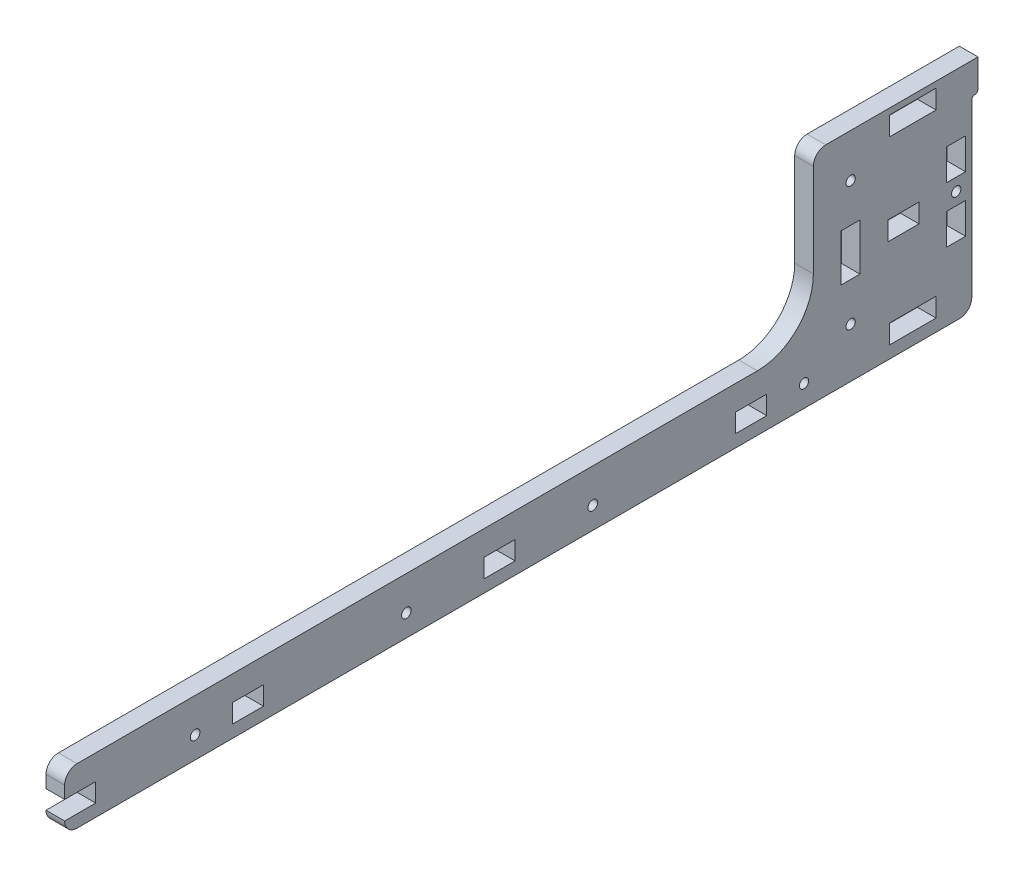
ISO-10303-21;
HEADER;
FILE_DESCRIPTION(('STEP AP214'),'2;1');
FILE_NAME('part.step','',(''),(''),'','','');
FILE_SCHEMA(('AUTOMOTIVE_DESIGN { 1 0 10303 214 1 1 1 1 }'));
ENDSEC;
DATA;
#1=APPLICATION_CONTEXT('core data for automotive mechanical design processes');
#2=APPLICATION_PROTOCOL_DEFINITION('international standard','automotive_design',2000,#1);
#3=PRODUCT_CONTEXT('',#1,'mechanical');
#4=PRODUCT('Part','Part','',(#3));
#5=PRODUCT_RELATED_PRODUCT_CATEGORY('part','',(#4));
#6=PRODUCT_DEFINITION_FORMATION('','',#4);
#7=PRODUCT_DEFINITION_CONTEXT('part definition',#1,'design');
#8=PRODUCT_DEFINITION('design','',#6,#7);
#9=PRODUCT_DEFINITION_SHAPE('','',#8);
#10=(LENGTH_UNIT() NAMED_UNIT(*) SI_UNIT(.MILLI.,.METRE.));
#11=(NAMED_UNIT(*) PLANE_ANGLE_UNIT() SI_UNIT($,.RADIAN.));
#12=(NAMED_UNIT(*) SI_UNIT($,.STERADIAN.) SOLID_ANGLE_UNIT());
#13=UNCERTAINTY_MEASURE_WITH_UNIT(LENGTH_MEASURE(1.E-05),#10,'distance_accuracy_value','');
#14=(GEOMETRIC_REPRESENTATION_CONTEXT(3) GLOBAL_UNCERTAINTY_ASSIGNED_CONTEXT((#13)) GLOBAL_UNIT_ASSIGNED_CONTEXT((#10,
#11,#12)) REPRESENTATION_CONTEXT('',''));
#15=CARTESIAN_POINT('',(0.,0.,0.));
#16=DIRECTION('',(0.,0.,1.));
#17=DIRECTION('',(1.,0.,0.));
#18=AXIS2_PLACEMENT_3D('',#15,#16,#17);
#19=CARTESIAN_POINT('',(6.,70.,0.));
#20=DIRECTION('',(0.,0.,1.));
#21=DIRECTION('',(0.,-1.,0.));
#22=AXIS2_PLACEMENT_3D('',#19,#20,#21);
#23=PLANE('',#22);
#24=DIRECTION('',(0.,1.,0.));
#25=VECTOR('',#24,1.);
#26=CARTESIAN_POINT('',(0.,70.,0.));
#27=LINE('',#26,#25);
#28=CARTESIAN_POINT('',(0.,4.,0.));
#29=VERTEX_POINT('',#28);
#30=CARTESIAN_POINT('',(0.,59.,0.));
#31=VERTEX_POINT('',#30);
#32=EDGE_CURVE('E747',#29,#31,#27,.T.);
#33=ORIENTED_EDGE('',*,*,#32,.T.);
#34=DIRECTION('',(1.,0.,0.));
#35=VECTOR('',#34,1.);
#36=CARTESIAN_POINT('',(6.,59.,0.));
#37=LINE('',#36,#35);
#38=CARTESIAN_POINT('',(6.,59.,0.));
#39=VERTEX_POINT('',#38);
#40=EDGE_CURVE('E825',#31,#39,#37,.T.);
#41=ORIENTED_EDGE('',*,*,#40,.T.);
#42=DIRECTION('',(0.,1.,0.));
#43=VECTOR('',#42,1.);
#44=CARTESIAN_POINT('',(6.,70.,0.));
#45=LINE('',#44,#43);
#46=CARTESIAN_POINT('',(6.,4.,0.));
#47=VERTEX_POINT('',#46);
#48=EDGE_CURVE('E387',#47,#39,#45,.T.);
#49=ORIENTED_EDGE('',*,*,#48,.F.);
#50=DIRECTION('',(-1.,0.,0.));
#51=VECTOR('',#50,1.);
#52=CARTESIAN_POINT('',(6.,4.,0.));
#53=LINE('',#52,#51);
#54=EDGE_CURVE('E785',#47,#29,#53,.T.);
#55=ORIENTED_EDGE('',*,*,#54,.T.);
#56=EDGE_LOOP('',(#33,#41,#49,#55));
#57=FACE_BOUND('',#56,.T.);
#58=ADVANCED_FACE('F32',(#57),#23,.F.);
#59=CARTESIAN_POINT('',(6.,70.,51.));
#60=DIRECTION('',(0.,-1.,0.));
#61=DIRECTION('',(0.,0.,-1.));
#62=AXIS2_PLACEMENT_3D('',#59,#60,#61);
#63=PLANE('',#62);
#64=DIRECTION('',(0.,0.,1.));
#65=VECTOR('',#64,1.);
#66=CARTESIAN_POINT('',(0.,70.,51.));
#67=LINE('',#66,#65);
#68=CARTESIAN_POINT('',(0.,70.,-2.00000000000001));
#69=VERTEX_POINT('',#68);
#70=CARTESIAN_POINT('',(0.,70.,47.));
#71=VERTEX_POINT('',#70);
#72=EDGE_CURVE('E766',#69,#71,#67,.T.);
#73=ORIENTED_EDGE('',*,*,#72,.T.);
#74=DIRECTION('',(-1.,0.,0.));
#75=VECTOR('',#74,1.);
#76=CARTESIAN_POINT('',(6.,70.,47.));
#77=LINE('',#76,#75);
#78=CARTESIAN_POINT('',(6.,70.,47.));
#79=VERTEX_POINT('',#78);
#80=EDGE_CURVE('E385',#71,#79,#77,.F.);
#81=ORIENTED_EDGE('',*,*,#80,.T.);
#82=DIRECTION('',(0.,0.,1.));
#83=VECTOR('',#82,1.);
#84=CARTESIAN_POINT('',(6.,70.,51.));
#85=LINE('',#84,#83);
#86=CARTESIAN_POINT('',(6.,70.,-2.00000000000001));
#87=VERTEX_POINT('',#86);
#88=EDGE_CURVE('E370',#87,#79,#85,.T.);
#89=ORIENTED_EDGE('',*,*,#88,.F.);
#90=DIRECTION('',(1.,0.,0.));
#91=VECTOR('',#90,1.);
#92=CARTESIAN_POINT('',(-10.1980390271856,70.,-2.00000000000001));
#93=LINE('',#92,#91);
#94=EDGE_CURVE('E378',#69,#87,#93,.T.);
#95=ORIENTED_EDGE('',*,*,#94,.F.);
#96=EDGE_LOOP('',(#73,#81,#89,#95));
#97=FACE_BOUND('',#96,.T.);
#98=ADVANCED_FACE('F383',(#97),#63,.F.);
#99=CARTESIAN_POINT('',(6.,36.,51.));
#100=DIRECTION('',(0.,0.,-1.));
#101=DIRECTION('',(0.,1.,0.));
#102=AXIS2_PLACEMENT_3D('',#99,#100,#101);
#103=PLANE('',#102);
#104=DIRECTION('',(0.,-1.,0.));
#105=VECTOR('',#104,1.);
#106=CARTESIAN_POINT('',(6.,36.,51.));
#107=LINE('',#106,#105);
#108=CARTESIAN_POINT('',(6.,66.,51.));
#109=VERTEX_POINT('',#108);
#110=CARTESIAN_POINT('',(6.,36.,51.));
#111=VERTEX_POINT('',#110);
#112=EDGE_CURVE('E386',#109,#111,#107,.T.);
#113=ORIENTED_EDGE('',*,*,#112,.F.);
#114=DIRECTION('',(-1.,0.,0.));
#115=VECTOR('',#114,1.);
#116=CARTESIAN_POINT('',(6.,66.,51.));
#117=LINE('',#116,#115);
#118=CARTESIAN_POINT('',(0.,66.,51.));
#119=VERTEX_POINT('',#118);
#120=EDGE_CURVE('E817',#109,#119,#117,.T.);
#121=ORIENTED_EDGE('',*,*,#120,.T.);
#122=DIRECTION('',(0.,-1.,0.));
#123=VECTOR('',#122,1.);
#124=CARTESIAN_POINT('',(0.,36.,51.));
#125=LINE('',#124,#123);
#126=CARTESIAN_POINT('',(0.,36.,51.));
#127=VERTEX_POINT('',#126);
#128=EDGE_CURVE('E768',#119,#127,#125,.T.);
#129=ORIENTED_EDGE('',*,*,#128,.T.);
#130=DIRECTION('',(-1.,0.,0.));
#131=VECTOR('',#130,1.);
#132=CARTESIAN_POINT('',(6.,36.,51.));
#133=LINE('',#132,#131);
#134=EDGE_CURVE('E782',#111,#127,#133,.T.);
#135=ORIENTED_EDGE('',*,*,#134,.F.);
#136=EDGE_LOOP('',(#113,#121,#129,#135));
#137=FACE_BOUND('',#136,.T.);
#138=ADVANCED_FACE('F843',(#137),#103,.F.);
#139=CARTESIAN_POINT('',(6.,36.,69.));
#140=DIRECTION('',(-1.,0.,0.));
#141=DIRECTION('',(0.,0.,1.));
#142=AXIS2_PLACEMENT_3D('',#139,#140,#141);
#143=CYLINDRICAL_SURFACE('',#142,18.);
#144=CARTESIAN_POINT('',(0.,36.,69.));
#145=DIRECTION('',(-1.,0.,0.));
#146=DIRECTION('',(0.,0.,-1.));
#147=AXIS2_PLACEMENT_3D('',#144,#145,#146);
#148=CIRCLE('',#147,18.);
#149=CARTESIAN_POINT('',(0.,18.,69.));
#150=VERTEX_POINT('',#149);
#151=EDGE_CURVE('E770',#127,#150,#148,.T.);
#152=ORIENTED_EDGE('',*,*,#151,.T.);
#153=DIRECTION('',(-1.,0.,0.));
#154=VECTOR('',#153,1.);
#155=CARTESIAN_POINT('',(6.,18.,69.));
#156=LINE('',#155,#154);
#157=CARTESIAN_POINT('',(6.,18.,69.));
#158=VERTEX_POINT('',#157);
#159=EDGE_CURVE('E764',#158,#150,#156,.T.);
#160=ORIENTED_EDGE('',*,*,#159,.F.);
#161=CARTESIAN_POINT('',(6.,36.,69.));
#162=DIRECTION('',(-1.,0.,0.));
#163=DIRECTION('',(0.,0.,-1.));
#164=AXIS2_PLACEMENT_3D('',#161,#162,#163);
#165=CIRCLE('',#164,18.);
#166=EDGE_CURVE('E753',#111,#158,#165,.T.);
#167=ORIENTED_EDGE('',*,*,#166,.F.);
#168=ORIENTED_EDGE('',*,*,#134,.T.);
#169=EDGE_LOOP('',(#152,#160,#167,#168));
#170=FACE_BOUND('',#169,.T.);
#171=ADVANCED_FACE('F848',(#170),#143,.F.);
#172=CARTESIAN_POINT('',(6.,18.,69.));
#173=DIRECTION('',(0.,-1.,0.));
#174=DIRECTION('',(0.,0.,-1.));
#175=AXIS2_PLACEMENT_3D('',#172,#173,#174);
#176=PLANE('',#175);
#177=DIRECTION('',(0.,0.,1.));
#178=VECTOR('',#177,1.);
#179=CARTESIAN_POINT('',(0.,18.,69.));
#180=LINE('',#179,#178);
#181=CARTESIAN_POINT('',(0.,18.,288.));
#182=VERTEX_POINT('',#181);
#183=EDGE_CURVE('E772',#150,#182,#180,.T.);
#184=ORIENTED_EDGE('',*,*,#183,.T.);
#185=DIRECTION('',(-1.,0.,0.));
#186=VECTOR('',#185,1.);
#187=CARTESIAN_POINT('',(6.,18.,288.));
#188=LINE('',#187,#186);
#189=CARTESIAN_POINT('',(6.,18.,288.));
#190=VERTEX_POINT('',#189);
#191=EDGE_CURVE('E815',#182,#190,#188,.F.);
#192=ORIENTED_EDGE('',*,*,#191,.T.);
#193=DIRECTION('',(0.,0.,1.));
#194=VECTOR('',#193,1.);
#195=CARTESIAN_POINT('',(6.,18.,69.));
#196=LINE('',#195,#194);
#197=EDGE_CURVE('E755',#158,#190,#196,.T.);
#198=ORIENTED_EDGE('',*,*,#197,.F.);
#199=ORIENTED_EDGE('',*,*,#159,.T.);
#200=EDGE_LOOP('',(#184,#192,#198,#199));
#201=FACE_BOUND('',#200,.T.);
#202=ADVANCED_FACE('F1101',(#201),#176,.F.);
#203=CARTESIAN_POINT('',(6.,18.,292.));
#204=DIRECTION('',(0.,0.,-1.));
#205=DIRECTION('',(-1.,0.,0.));
#206=AXIS2_PLACEMENT_3D('',#203,#204,#205);
#207=PLANE('',#206);
#208=DIRECTION('',(0.,-1.,0.));
#209=VECTOR('',#208,1.);
#210=CARTESIAN_POINT('',(0.,18.,292.));
#211=LINE('',#210,#209);
#212=CARTESIAN_POINT('',(0.,14.,292.));
#213=VERTEX_POINT('',#212);
#214=CARTESIAN_POINT('',(0.,9.99999999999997,292.));
#215=VERTEX_POINT('',#214);
#216=EDGE_CURVE('E775',#213,#215,#211,.T.);
#217=ORIENTED_EDGE('',*,*,#216,.T.);
#218=DIRECTION('',(1.,0.,0.));
#219=VECTOR('',#218,1.);
#220=CARTESIAN_POINT('',(0.,9.99999999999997,292.));
#221=LINE('',#220,#219);
#222=CARTESIAN_POINT('',(6.,9.99999999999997,292.));
#223=VERTEX_POINT('',#222);
#224=EDGE_CURVE('E527',#215,#223,#221,.T.);
#225=ORIENTED_EDGE('',*,*,#224,.T.);
#226=DIRECTION('',(0.,-1.,0.));
#227=VECTOR('',#226,1.);
#228=CARTESIAN_POINT('',(6.,18.,292.));
#229=LINE('',#228,#227);
#230=CARTESIAN_POINT('',(6.,14.,292.));
#231=VERTEX_POINT('',#230);
#232=EDGE_CURVE('E758',#231,#223,#229,.T.);
#233=ORIENTED_EDGE('',*,*,#232,.F.);
#234=DIRECTION('',(-1.,0.,0.));
#235=VECTOR('',#234,1.);
#236=CARTESIAN_POINT('',(6.,14.,292.));
#237=LINE('',#236,#235);
#238=EDGE_CURVE('E810',#231,#213,#237,.T.);
#239=ORIENTED_EDGE('',*,*,#238,.T.);
#240=EDGE_LOOP('',(#217,#225,#233,#239));
#241=FACE_BOUND('',#240,.T.);
#242=ADVANCED_FACE('F859',(#241),#207,.F.);
#243=CARTESIAN_POINT('',(6.,0.,292.));
#244=DIRECTION('',(0.,1.,0.));
#245=DIRECTION('',(0.,0.,1.));
#246=AXIS2_PLACEMENT_3D('',#243,#244,#245);
#247=PLANE('',#246);
#248=DIRECTION('',(0.,0.,-1.));
#249=VECTOR('',#248,1.);
#250=CARTESIAN_POINT('',(0.,0.,292.));
#251=LINE('',#250,#249);
#252=CARTESIAN_POINT('',(0.,0.,288.));
#253=VERTEX_POINT('',#252);
#254=CARTESIAN_POINT('',(0.,0.,4.));
#255=VERTEX_POINT('',#254);
#256=EDGE_CURVE('E750',#253,#255,#251,.T.);
#257=ORIENTED_EDGE('',*,*,#256,.T.);
#258=DIRECTION('',(-1.,0.,0.));
#259=VECTOR('',#258,1.);
#260=CARTESIAN_POINT('',(6.,0.,4.));
#261=LINE('',#260,#259);
#262=CARTESIAN_POINT('',(6.,0.,4.));
#263=VERTEX_POINT('',#262);
#264=EDGE_CURVE('E800',#255,#263,#261,.F.);
#265=ORIENTED_EDGE('',*,*,#264,.T.);
#266=DIRECTION('',(0.,0.,-1.));
#267=VECTOR('',#266,1.);
#268=CARTESIAN_POINT('',(6.,0.,292.));
#269=LINE('',#268,#267);
#270=CARTESIAN_POINT('',(6.,0.,288.));
#271=VERTEX_POINT('',#270);
#272=EDGE_CURVE('E761',#271,#263,#269,.T.);
#273=ORIENTED_EDGE('',*,*,#272,.F.);
#274=DIRECTION('',(-1.,0.,0.));
#275=VECTOR('',#274,1.);
#276=CARTESIAN_POINT('',(6.,0.,288.));
#277=LINE('',#276,#275);
#278=EDGE_CURVE('E797',#271,#253,#277,.T.);
#279=ORIENTED_EDGE('',*,*,#278,.T.);
#280=EDGE_LOOP('',(#257,#265,#273,#279));
#281=FACE_BOUND('',#280,.T.);
#282=ADVANCED_FACE('F880',(#281),#247,.F.);
#283=CARTESIAN_POINT('',(6.,36.,69.));
#284=DIRECTION('',(1.,0.,0.));
#285=DIRECTION('',(0.,0.,-1.));
#286=AXIS2_PLACEMENT_3D('',#283,#284,#285);
#287=PLANE('',#286);
#288=CARTESIAN_POINT('',(6.,6.99999999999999,122.));
#289=DIRECTION('',(1.,0.,0.));
#290=DIRECTION('',(0.,0.,-1.));
#291=AXIS2_PLACEMENT_3D('',#288,#289,#290);
#292=CIRCLE('',#291,1.54999999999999);
#293=CARTESIAN_POINT('',(6.,6.99999999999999,120.45));
#294=VERTEX_POINT('',#293);
#295=EDGE_CURVE('E393',#294,#294,#292,.T.);
#296=ORIENTED_EDGE('',*,*,#295,.F.);
#297=EDGE_LOOP('',(#296));
#298=FACE_BOUND('',#297,.T.);
#299=CARTESIAN_POINT('',(6.,6.99999999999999,182.));
#300=DIRECTION('',(1.,0.,0.));
#301=DIRECTION('',(0.,0.,-1.));
#302=AXIS2_PLACEMENT_3D('',#299,#300,#301);
#303=CIRCLE('',#302,1.54999999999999);
#304=CARTESIAN_POINT('',(6.,6.99999999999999,180.45));
#305=VERTEX_POINT('',#304);
#306=EDGE_CURVE('E399',#305,#305,#303,.T.);
#307=ORIENTED_EDGE('',*,*,#306,.F.);
#308=EDGE_LOOP('',(#307));
#309=FACE_BOUND('',#308,.T.);
#310=CARTESIAN_POINT('',(6.,6.99999999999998,250.));
#311=DIRECTION('',(1.,0.,0.));
#312=DIRECTION('',(0.,0.,-1.));
#313=AXIS2_PLACEMENT_3D('',#310,#311,#312);
#314=CIRCLE('',#313,1.54999999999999);
#315=CARTESIAN_POINT('',(6.,6.99999999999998,248.45));
#316=VERTEX_POINT('',#315);
#317=EDGE_CURVE('E405',#316,#316,#314,.T.);
#318=ORIENTED_EDGE('',*,*,#317,.F.);
#319=EDGE_LOOP('',(#318));
#320=FACE_BOUND('',#319,.T.);
#321=DIRECTION('',(0.,-1.,0.));
#322=VECTOR('',#321,1.);
#323=CARTESIAN_POINT('',(6.,9.99999999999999,76.));
#324=LINE('',#323,#322);
#325=CARTESIAN_POINT('',(6.,9.99999999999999,76.));
#326=VERTEX_POINT('',#325);
#327=CARTESIAN_POINT('',(6.,3.99999999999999,76.));
#328=VERTEX_POINT('',#327);
#329=EDGE_CURVE('E411',#326,#328,#324,.T.);
#330=ORIENTED_EDGE('',*,*,#329,.F.);
#331=DIRECTION('',(0.,0.,1.));
#332=VECTOR('',#331,1.);
#333=CARTESIAN_POINT('',(6.,9.99999999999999,76.));
#334=LINE('',#333,#332);
#335=CARTESIAN_POINT('',(6.,9.99999999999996,66.));
#336=VERTEX_POINT('',#335);
#337=EDGE_CURVE('E418',#336,#326,#334,.T.);
#338=ORIENTED_EDGE('',*,*,#337,.F.);
#339=DIRECTION('',(0.,1.,0.));
#340=VECTOR('',#339,1.);
#341=CARTESIAN_POINT('',(6.,9.99999999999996,66.));
#342=LINE('',#341,#340);
#343=CARTESIAN_POINT('',(6.,4.00000000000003,66.));
#344=VERTEX_POINT('',#343);
#345=EDGE_CURVE('E432',#344,#336,#342,.T.);
#346=ORIENTED_EDGE('',*,*,#345,.F.);
#347=DIRECTION('',(0.,0.,-1.));
#348=VECTOR('',#347,1.);
#349=CARTESIAN_POINT('',(6.,3.99999999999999,76.));
#350=LINE('',#349,#348);
#351=EDGE_CURVE('E429',#328,#344,#350,.T.);
#352=ORIENTED_EDGE('',*,*,#351,.F.);
#353=EDGE_LOOP('',(#330,#338,#346,#352));
#354=FACE_BOUND('',#353,.T.);
#355=DIRECTION('',(0.,-1.,0.));
#356=VECTOR('',#355,1.);
#357=CARTESIAN_POINT('',(6.,9.99999999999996,157.));
#358=LINE('',#357,#356);
#359=CARTESIAN_POINT('',(6.,9.99999999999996,157.));
#360=VERTEX_POINT('',#359);
#361=CARTESIAN_POINT('',(6.,4.00000000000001,157.));
#362=VERTEX_POINT('',#361);
#363=EDGE_CURVE('E439',#360,#362,#358,.T.);
#364=ORIENTED_EDGE('',*,*,#363,.F.);
#365=DIRECTION('',(0.,0.,1.));
#366=VECTOR('',#365,1.);
#367=CARTESIAN_POINT('',(6.,9.99999999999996,157.));
#368=LINE('',#367,#366);
#369=CARTESIAN_POINT('',(6.,9.99999999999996,147.));
#370=VERTEX_POINT('',#369);
#371=EDGE_CURVE('E450',#370,#360,#368,.T.);
#372=ORIENTED_EDGE('',*,*,#371,.F.);
#373=DIRECTION('',(0.,1.,0.));
#374=VECTOR('',#373,1.);
#375=CARTESIAN_POINT('',(6.,9.99999999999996,147.));
#376=LINE('',#375,#374);
#377=CARTESIAN_POINT('',(6.,4.00000000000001,147.));
#378=VERTEX_POINT('',#377);
#379=EDGE_CURVE('E464',#378,#370,#376,.T.);
#380=ORIENTED_EDGE('',*,*,#379,.F.);
#381=DIRECTION('',(0.,0.,-1.));
#382=VECTOR('',#381,1.);
#383=CARTESIAN_POINT('',(6.,4.00000000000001,157.));
#384=LINE('',#383,#382);
#385=EDGE_CURVE('E461',#362,#378,#384,.T.);
#386=ORIENTED_EDGE('',*,*,#385,.F.);
#387=EDGE_LOOP('',(#364,#372,#380,#386));
#388=FACE_BOUND('',#387,.T.);
#389=DIRECTION('',(0.,-1.,0.));
#390=VECTOR('',#389,1.);
#391=CARTESIAN_POINT('',(6.,9.99999999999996,238.));
#392=LINE('',#391,#390);
#393=CARTESIAN_POINT('',(6.,9.99999999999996,238.));
#394=VERTEX_POINT('',#393);
#395=CARTESIAN_POINT('',(6.,3.99999999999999,238.));
#396=VERTEX_POINT('',#395);
#397=EDGE_CURVE('E471',#394,#396,#392,.T.);
#398=ORIENTED_EDGE('',*,*,#397,.F.);
#399=DIRECTION('',(0.,0.,1.));
#400=VECTOR('',#399,1.);
#401=CARTESIAN_POINT('',(6.,9.99999999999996,238.));
#402=LINE('',#401,#400);
#403=CARTESIAN_POINT('',(6.,9.99999999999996,228.));
#404=VERTEX_POINT('',#403);
#405=EDGE_CURVE('E482',#404,#394,#402,.T.);
#406=ORIENTED_EDGE('',*,*,#405,.F.);
#407=DIRECTION('',(0.,1.,0.));
#408=VECTOR('',#407,1.);
#409=CARTESIAN_POINT('',(6.,9.99999999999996,228.));
#410=LINE('',#409,#408);
#411=CARTESIAN_POINT('',(6.,3.99999999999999,228.));
#412=VERTEX_POINT('',#411);
#413=EDGE_CURVE('E496',#412,#404,#410,.T.);
#414=ORIENTED_EDGE('',*,*,#413,.F.);
#415=DIRECTION('',(0.,0.,-1.));
#416=VECTOR('',#415,1.);
#417=CARTESIAN_POINT('',(6.,3.99999999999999,238.));
#418=LINE('',#417,#416);
#419=EDGE_CURVE('E493',#396,#412,#418,.T.);
#420=ORIENTED_EDGE('',*,*,#419,.F.);
#421=EDGE_LOOP('',(#398,#406,#414,#420));
#422=FACE_BOUND('',#421,.T.);
#423=ORIENTED_EDGE('',*,*,#48,.T.);
#424=CARTESIAN_POINT('',(6.,59.,-1.00000000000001));
#425=DIRECTION('',(1.,0.,0.));
#426=DIRECTION('',(0.,0.,-1.));
#427=AXIS2_PLACEMENT_3D('',#424,#425,#426);
#428=CIRCLE('',#427,1.);
#429=CARTESIAN_POINT('',(6.,60.,-1.00000000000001));
#430=VERTEX_POINT('',#429);
#431=EDGE_CURVE('E41',#39,#430,#428,.F.);
#432=ORIENTED_EDGE('',*,*,#431,.T.);
#433=CARTESIAN_POINT('',(6.,61.,-1.00000000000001));
#434=DIRECTION('',(1.,0.,0.));
#435=DIRECTION('',(0.,0.,-1.));
#436=AXIS2_PLACEMENT_3D('',#433,#434,#435);
#437=CIRCLE('',#436,1.);
#438=CARTESIAN_POINT('',(6.,61.,-2.00000000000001));
#439=VERTEX_POINT('',#438);
#440=EDGE_CURVE('E373',#430,#439,#437,.T.);
#441=ORIENTED_EDGE('',*,*,#440,.T.);
#442=DIRECTION('',(0.,1.,0.));
#443=VECTOR('',#442,1.);
#444=CARTESIAN_POINT('',(6.,70.,-2.00000000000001));
#445=LINE('',#444,#443);
#446=EDGE_CURVE('E365',#439,#87,#445,.T.);
#447=ORIENTED_EDGE('',*,*,#446,.T.);
#448=ORIENTED_EDGE('',*,*,#88,.T.);
#449=CARTESIAN_POINT('',(6.,66.,47.));
#450=DIRECTION('',(1.,0.,0.));
#451=DIRECTION('',(0.,0.,-1.));
#452=AXIS2_PLACEMENT_3D('',#449,#450,#451);
#453=CIRCLE('',#452,4.);
#454=EDGE_CURVE('E802',#79,#109,#453,.T.);
#455=ORIENTED_EDGE('',*,*,#454,.T.);
#456=ORIENTED_EDGE('',*,*,#112,.T.);
#457=ORIENTED_EDGE('',*,*,#166,.T.);
#458=ORIENTED_EDGE('',*,*,#197,.T.);
#459=CARTESIAN_POINT('',(6.,14.,288.));
#460=DIRECTION('',(1.,0.,0.));
#461=DIRECTION('',(0.,0.,-1.));
#462=AXIS2_PLACEMENT_3D('',#459,#460,#461);
#463=CIRCLE('',#462,4.);
#464=EDGE_CURVE('E804',#190,#231,#463,.T.);
#465=ORIENTED_EDGE('',*,*,#464,.T.);
#466=ORIENTED_EDGE('',*,*,#232,.T.);
#467=DIRECTION('',(0.,0.,1.));
#468=VECTOR('',#467,1.);
#469=CARTESIAN_POINT('',(6.,9.99999999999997,292.));
#470=LINE('',#469,#468);
#471=CARTESIAN_POINT('',(6.,9.99999999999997,282.));
#472=VERTEX_POINT('',#471);
#473=EDGE_CURVE('E514',#472,#223,#470,.T.);
#474=ORIENTED_EDGE('',*,*,#473,.F.);
#475=DIRECTION('',(0.,1.,0.));
#476=VECTOR('',#475,1.);
#477=CARTESIAN_POINT('',(6.,9.99999999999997,282.));
#478=LINE('',#477,#476);
#479=CARTESIAN_POINT('',(6.,3.99999999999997,282.));
#480=VERTEX_POINT('',#479);
#481=EDGE_CURVE('E523',#480,#472,#478,.T.);
#482=ORIENTED_EDGE('',*,*,#481,.F.);
#483=DIRECTION('',(0.,0.,-1.));
#484=VECTOR('',#483,1.);
#485=CARTESIAN_POINT('',(6.,3.99999999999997,292.));
#486=LINE('',#485,#484);
#487=CARTESIAN_POINT('',(6.,3.99999999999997,292.));
#488=VERTEX_POINT('',#487);
#489=EDGE_CURVE('E503',#488,#480,#486,.T.);
#490=ORIENTED_EDGE('',*,*,#489,.F.);
#491=CARTESIAN_POINT('',(6.,4.,288.));
#492=DIRECTION('',(1.,0.,0.));
#493=DIRECTION('',(0.,0.,-1.));
#494=AXIS2_PLACEMENT_3D('',#491,#492,#493);
#495=CIRCLE('',#494,4.);
#496=EDGE_CURVE('E806',#488,#271,#495,.T.);
#497=ORIENTED_EDGE('',*,*,#496,.T.);
#498=ORIENTED_EDGE('',*,*,#272,.T.);
#499=CARTESIAN_POINT('',(6.,4.,4.));
#500=DIRECTION('',(1.,0.,0.));
#501=DIRECTION('',(0.,0.,-1.));
#502=AXIS2_PLACEMENT_3D('',#499,#500,#501);
#503=CIRCLE('',#502,4.);
#504=EDGE_CURVE('E808',#263,#47,#503,.T.);
#505=ORIENTED_EDGE('',*,*,#504,.T.);
#506=EDGE_LOOP('',(#423,#432,#441,#447,#448,#455,#456,#457,#458,#465,#466,#474,#482,#490,#497,
#498,#505));
#507=FACE_BOUND('',#506,.T.);
#508=DIRECTION('',(0.,-1.,0.));
#509=VECTOR('',#508,1.);
#510=CARTESIAN_POINT('',(6.,3.95000000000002,26.5));
#511=LINE('',#510,#509);
#512=CARTESIAN_POINT('',(6.,10.05,26.5));
#513=VERTEX_POINT('',#512);
#514=CARTESIAN_POINT('',(6.,3.95000000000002,26.5));
#515=VERTEX_POINT('',#514);
#516=EDGE_CURVE('E530',#513,#515,#511,.T.);
#517=ORIENTED_EDGE('',*,*,#516,.F.);
#518=DIRECTION('',(0.,0.,1.));
#519=VECTOR('',#518,1.);
#520=CARTESIAN_POINT('',(6.,10.05,26.5));
#521=LINE('',#520,#519);
#522=CARTESIAN_POINT('',(6.,10.05,11.5));
#523=VERTEX_POINT('',#522);
#524=EDGE_CURVE('E604',#523,#513,#521,.T.);
#525=ORIENTED_EDGE('',*,*,#524,.F.);
#526=DIRECTION('',(0.,1.,0.));
#527=VECTOR('',#526,1.);
#528=CARTESIAN_POINT('',(6.,3.95000000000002,11.5));
#529=LINE('',#528,#527);
#530=CARTESIAN_POINT('',(6.,3.95000000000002,11.5));
#531=VERTEX_POINT('',#530);
#532=EDGE_CURVE('E618',#531,#523,#529,.T.);
#533=ORIENTED_EDGE('',*,*,#532,.F.);
#534=DIRECTION('',(0.,0.,-1.));
#535=VECTOR('',#534,1.);
#536=CARTESIAN_POINT('',(6.,3.95000000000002,26.5));
#537=LINE('',#536,#535);
#538=EDGE_CURVE('E615',#515,#531,#537,.T.);
#539=ORIENTED_EDGE('',*,*,#538,.F.);
#540=EDGE_LOOP('',(#517,#525,#533,#539));
#541=FACE_BOUND('',#540,.T.);
#542=DIRECTION('',(0.,1.,0.));
#543=VECTOR('',#542,1.);
#544=CARTESIAN_POINT('',(6.,68.05,11.5));
#545=LINE('',#544,#543);
#546=CARTESIAN_POINT('',(6.,61.95,11.5));
#547=VERTEX_POINT('',#546);
#548=CARTESIAN_POINT('',(6.,68.05,11.5));
#549=VERTEX_POINT('',#548);
#550=EDGE_CURVE('E582',#547,#549,#545,.T.);
#551=ORIENTED_EDGE('',*,*,#550,.F.);
#552=DIRECTION('',(0.,0.,-1.));
#553=VECTOR('',#552,1.);
#554=CARTESIAN_POINT('',(6.,61.95,26.5));
#555=LINE('',#554,#553);
#556=CARTESIAN_POINT('',(6.,61.95,26.5));
#557=VERTEX_POINT('',#556);
#558=EDGE_CURVE('E572',#557,#547,#555,.T.);
#559=ORIENTED_EDGE('',*,*,#558,.F.);
#560=DIRECTION('',(0.,-1.,0.));
#561=VECTOR('',#560,1.);
#562=CARTESIAN_POINT('',(6.,68.05,26.5));
#563=LINE('',#562,#561);
#564=CARTESIAN_POINT('',(6.,68.05,26.5));
#565=VERTEX_POINT('',#564);
#566=EDGE_CURVE('E588',#565,#557,#563,.T.);
#567=ORIENTED_EDGE('',*,*,#566,.F.);
#568=DIRECTION('',(0.,0.,1.));
#569=VECTOR('',#568,1.);
#570=CARTESIAN_POINT('',(6.,68.05,26.5));
#571=LINE('',#570,#569);
#572=EDGE_CURVE('E584',#549,#565,#571,.T.);
#573=ORIENTED_EDGE('',*,*,#572,.F.);
#574=EDGE_LOOP('',(#551,#559,#567,#573));
#575=FACE_BOUND('',#574,.T.);
#576=DIRECTION('',(0.,0.,-1.));
#577=VECTOR('',#576,1.);
#578=CARTESIAN_POINT('',(6.,22.,8.1));
#579=LINE('',#578,#577);
#580=CARTESIAN_POINT('',(6.,22.,8.1));
#581=VERTEX_POINT('',#580);
#582=CARTESIAN_POINT('',(6.,22.,2.));
#583=VERTEX_POINT('',#582);
#584=EDGE_CURVE('E548',#581,#583,#579,.T.);
#585=ORIENTED_EDGE('',*,*,#584,.F.);
#586=DIRECTION('',(0.,-1.,0.));
#587=VECTOR('',#586,1.);
#588=CARTESIAN_POINT('',(6.,22.,8.1));
#589=LINE('',#588,#587);
#590=CARTESIAN_POINT('',(6.,32.,8.1));
#591=VERTEX_POINT('',#590);
#592=EDGE_CURVE('E538',#591,#581,#589,.T.);
#593=ORIENTED_EDGE('',*,*,#592,.F.);
#594=DIRECTION('',(0.,0.,1.));
#595=VECTOR('',#594,1.);
#596=CARTESIAN_POINT('',(6.,32.,8.1));
#597=LINE('',#596,#595);
#598=CARTESIAN_POINT('',(6.,32.,2.));
#599=VERTEX_POINT('',#598);
#600=EDGE_CURVE('E554',#599,#591,#597,.T.);
#601=ORIENTED_EDGE('',*,*,#600,.F.);
#602=DIRECTION('',(0.,1.,0.));
#603=VECTOR('',#602,1.);
#604=CARTESIAN_POINT('',(6.,22.,1.99999999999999));
#605=LINE('',#604,#603);
#606=EDGE_CURVE('E550',#583,#599,#605,.T.);
#607=ORIENTED_EDGE('',*,*,#606,.F.);
#608=EDGE_LOOP('',(#585,#593,#601,#607));
#609=FACE_BOUND('',#608,.T.);
#610=DIRECTION('',(0.,1.,0.));
#611=VECTOR('',#610,1.);
#612=CARTESIAN_POINT('',(6.,39.05,17.));
#613=LINE('',#612,#611);
#614=CARTESIAN_POINT('',(6.,32.95,17.));
#615=VERTEX_POINT('',#614);
#616=CARTESIAN_POINT('',(6.,39.05,17.));
#617=VERTEX_POINT('',#616);
#618=EDGE_CURVE('E561',#615,#617,#613,.T.);
#619=ORIENTED_EDGE('',*,*,#618,.F.);
#620=DIRECTION('',(0.,0.,-1.));
#621=VECTOR('',#620,1.);
#622=CARTESIAN_POINT('',(6.,32.95,27.));
#623=LINE('',#622,#621);
#624=CARTESIAN_POINT('',(6.,32.95,27.));
#625=VERTEX_POINT('',#624);
#626=EDGE_CURVE('E668',#625,#615,#623,.T.);
#627=ORIENTED_EDGE('',*,*,#626,.F.);
#628=DIRECTION('',(0.,-1.,0.));
#629=VECTOR('',#628,1.);
#630=CARTESIAN_POINT('',(6.,39.05,27.));
#631=LINE('',#630,#629);
#632=CARTESIAN_POINT('',(6.,39.05,27.));
#633=VERTEX_POINT('',#632);
#634=EDGE_CURVE('E682',#633,#625,#631,.T.);
#635=ORIENTED_EDGE('',*,*,#634,.F.);
#636=DIRECTION('',(0.,0.,1.));
#637=VECTOR('',#636,1.);
#638=CARTESIAN_POINT('',(6.,39.05,27.));
#639=LINE('',#638,#637);
#640=EDGE_CURVE('E679',#617,#633,#639,.T.);
#641=ORIENTED_EDGE('',*,*,#640,.F.);
#642=EDGE_LOOP('',(#619,#627,#635,#641));
#643=FACE_BOUND('',#642,.T.);
#644=DIRECTION('',(0.,-1.,0.));
#645=VECTOR('',#644,1.);
#646=CARTESIAN_POINT('',(6.,43.55,42.1));
#647=LINE('',#646,#645);
#648=CARTESIAN_POINT('',(6.,43.55,42.1));
#649=VERTEX_POINT('',#648);
#650=CARTESIAN_POINT('',(6.,28.45,42.1));
#651=VERTEX_POINT('',#650);
#652=EDGE_CURVE('E644',#649,#651,#647,.T.);
#653=ORIENTED_EDGE('',*,*,#652,.F.);
#654=DIRECTION('',(0.,0.,1.));
#655=VECTOR('',#654,1.);
#656=CARTESIAN_POINT('',(6.,43.55,42.1));
#657=LINE('',#656,#655);
#658=CARTESIAN_POINT('',(6.,43.55,36.));
#659=VERTEX_POINT('',#658);
#660=EDGE_CURVE('E634',#659,#649,#657,.T.);
#661=ORIENTED_EDGE('',*,*,#660,.F.);
#662=DIRECTION('',(0.,1.,0.));
#663=VECTOR('',#662,1.);
#664=CARTESIAN_POINT('',(6.,43.55,36.));
#665=LINE('',#664,#663);
#666=CARTESIAN_POINT('',(6.,28.45,36.));
#667=VERTEX_POINT('',#666);
#668=EDGE_CURVE('E650',#667,#659,#665,.T.);
#669=ORIENTED_EDGE('',*,*,#668,.F.);
#670=DIRECTION('',(0.,0.,-1.));
#671=VECTOR('',#670,1.);
#672=CARTESIAN_POINT('',(6.,28.45,42.1));
#673=LINE('',#672,#671);
#674=EDGE_CURVE('E646',#651,#667,#673,.T.);
#675=ORIENTED_EDGE('',*,*,#674,.F.);
#676=EDGE_LOOP('',(#653,#661,#669,#675));
#677=FACE_BOUND('',#676,.T.);
#678=DIRECTION('',(0.,-1.,0.));
#679=VECTOR('',#678,1.);
#680=CARTESIAN_POINT('',(6.,50.,8.1));
#681=LINE('',#680,#679);
#682=CARTESIAN_POINT('',(6.,50.,8.1));
#683=VERTEX_POINT('',#682);
#684=CARTESIAN_POINT('',(6.,40.,8.1));
#685=VERTEX_POINT('',#684);
#686=EDGE_CURVE('E657',#683,#685,#681,.T.);
#687=ORIENTED_EDGE('',*,*,#686,.F.);
#688=DIRECTION('',(0.,0.,1.));
#689=VECTOR('',#688,1.);
#690=CARTESIAN_POINT('',(6.,50.,8.1));
#691=LINE('',#690,#689);
#692=CARTESIAN_POINT('',(6.,50.,2.));
#693=VERTEX_POINT('',#692);
#694=EDGE_CURVE('E698',#693,#683,#691,.T.);
#695=ORIENTED_EDGE('',*,*,#694,.F.);
#696=DIRECTION('',(0.,1.,0.));
#697=VECTOR('',#696,1.);
#698=CARTESIAN_POINT('',(6.,50.,2.));
#699=LINE('',#698,#697);
#700=CARTESIAN_POINT('',(6.,40.,2.));
#701=VERTEX_POINT('',#700);
#702=EDGE_CURVE('E712',#701,#693,#699,.T.);
#703=ORIENTED_EDGE('',*,*,#702,.F.);
#704=DIRECTION('',(0.,0.,-1.));
#705=VECTOR('',#704,1.);
#706=CARTESIAN_POINT('',(6.,40.,8.1));
#707=LINE('',#706,#705);
#708=EDGE_CURVE('E709',#685,#701,#707,.T.);
#709=ORIENTED_EDGE('',*,*,#708,.F.);
#710=EDGE_LOOP('',(#687,#695,#703,#709));
#711=FACE_BOUND('',#710,.T.);
#712=CARTESIAN_POINT('',(6.,56.,39.));
#713=DIRECTION('',(1.,0.,0.));
#714=DIRECTION('',(0.,0.,-1.));
#715=AXIS2_PLACEMENT_3D('',#712,#713,#714);
#716=CIRCLE('',#715,1.5);
#717=CARTESIAN_POINT('',(6.,56.,37.5));
#718=VERTEX_POINT('',#717);
#719=EDGE_CURVE('E719',#718,#718,#716,.T.);
#720=ORIENTED_EDGE('',*,*,#719,.F.);
#721=EDGE_LOOP('',(#720));
#722=FACE_BOUND('',#721,.T.);
#723=CARTESIAN_POINT('',(6.,36.,5.));
#724=DIRECTION('',(1.,0.,0.));
#725=DIRECTION('',(0.,0.,-1.));
#726=AXIS2_PLACEMENT_3D('',#723,#724,#725);
#727=CIRCLE('',#726,1.5);
#728=CARTESIAN_POINT('',(6.,36.,3.5));
#729=VERTEX_POINT('',#728);
#730=EDGE_CURVE('E729',#729,#729,#727,.T.);
#731=ORIENTED_EDGE('',*,*,#730,.F.);
#732=EDGE_LOOP('',(#731));
#733=FACE_BOUND('',#732,.T.);
#734=CARTESIAN_POINT('',(6.,16.,39.));
#735=DIRECTION('',(1.,0.,0.));
#736=DIRECTION('',(0.,0.,1.));
#737=AXIS2_PLACEMENT_3D('',#734,#735,#736);
#738=CIRCLE('',#737,1.5);
#739=CARTESIAN_POINT('',(6.,16.,40.5));
#740=VERTEX_POINT('',#739);
#741=EDGE_CURVE('E735',#740,#740,#738,.T.);
#742=ORIENTED_EDGE('',*,*,#741,.F.);
#743=EDGE_LOOP('',(#742));
#744=FACE_BOUND('',#743,.T.);
#745=CARTESIAN_POINT('',(6.,7.,54.));
#746=DIRECTION('',(1.,0.,0.));
#747=DIRECTION('',(0.,0.,-1.));
#748=AXIS2_PLACEMENT_3D('',#745,#746,#747);
#749=CIRCLE('',#748,1.5);
#750=CARTESIAN_POINT('',(6.,7.,52.5));
#751=VERTEX_POINT('',#750);
#752=EDGE_CURVE('E741',#751,#751,#749,.T.);
#753=ORIENTED_EDGE('',*,*,#752,.F.);
#754=EDGE_LOOP('',(#753));
#755=FACE_BOUND('',#754,.T.);
#756=ADVANCED_FACE('F368',(#298,#309,#320,#354,#388,#422,#507,#541,#575,#609,#643,#677,#711,
#722,#733,#744,#755),#287,.T.);
#757=CARTESIAN_POINT('',(0.,36.,69.));
#758=DIRECTION('',(1.,0.,0.));
#759=DIRECTION('',(0.,0.,-1.));
#760=AXIS2_PLACEMENT_3D('',#757,#758,#759);
#761=PLANE('',#760);
#762=CARTESIAN_POINT('',(0.,6.99999999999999,122.));
#763=DIRECTION('',(1.,0.,0.));
#764=DIRECTION('',(0.,0.,-1.));
#765=AXIS2_PLACEMENT_3D('',#762,#763,#764);
#766=CIRCLE('',#765,1.54999999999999);
#767=CARTESIAN_POINT('',(0.,6.99999999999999,120.45));
#768=VERTEX_POINT('',#767);
#769=EDGE_CURVE('E396',#768,#768,#766,.T.);
#770=ORIENTED_EDGE('',*,*,#769,.T.);
#771=EDGE_LOOP('',(#770));
#772=FACE_BOUND('',#771,.T.);
#773=CARTESIAN_POINT('',(0.,6.99999999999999,182.));
#774=DIRECTION('',(1.,0.,0.));
#775=DIRECTION('',(0.,0.,-1.));
#776=AXIS2_PLACEMENT_3D('',#773,#774,#775);
#777=CIRCLE('',#776,1.54999999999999);
#778=CARTESIAN_POINT('',(0.,6.99999999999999,180.45));
#779=VERTEX_POINT('',#778);
#780=EDGE_CURVE('E402',#779,#779,#777,.T.);
#781=ORIENTED_EDGE('',*,*,#780,.T.);
#782=EDGE_LOOP('',(#781));
#783=FACE_BOUND('',#782,.T.);
#784=CARTESIAN_POINT('',(0.,6.99999999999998,250.));
#785=DIRECTION('',(1.,0.,0.));
#786=DIRECTION('',(0.,0.,-1.));
#787=AXIS2_PLACEMENT_3D('',#784,#785,#786);
#788=CIRCLE('',#787,1.54999999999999);
#789=CARTESIAN_POINT('',(0.,6.99999999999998,248.45));
#790=VERTEX_POINT('',#789);
#791=EDGE_CURVE('E408',#790,#790,#788,.T.);
#792=ORIENTED_EDGE('',*,*,#791,.T.);
#793=EDGE_LOOP('',(#792));
#794=FACE_BOUND('',#793,.T.);
#795=DIRECTION('',(0.,0.,1.));
#796=VECTOR('',#795,1.);
#797=CARTESIAN_POINT('',(0.,9.99999999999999,76.));
#798=LINE('',#797,#796);
#799=CARTESIAN_POINT('',(0.,9.99999999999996,66.));
#800=VERTEX_POINT('',#799);
#801=CARTESIAN_POINT('',(0.,9.99999999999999,76.));
#802=VERTEX_POINT('',#801);
#803=EDGE_CURVE('E424',#800,#802,#798,.T.);
#804=ORIENTED_EDGE('',*,*,#803,.T.);
#805=DIRECTION('',(0.,-1.,0.));
#806=VECTOR('',#805,1.);
#807=CARTESIAN_POINT('',(0.,9.99999999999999,76.));
#808=LINE('',#807,#806);
#809=CARTESIAN_POINT('',(0.,3.99999999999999,76.));
#810=VERTEX_POINT('',#809);
#811=EDGE_CURVE('E414',#802,#810,#808,.T.);
#812=ORIENTED_EDGE('',*,*,#811,.T.);
#813=DIRECTION('',(0.,0.,-1.));
#814=VECTOR('',#813,1.);
#815=CARTESIAN_POINT('',(0.,3.99999999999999,76.));
#816=LINE('',#815,#814);
#817=CARTESIAN_POINT('',(0.,4.00000000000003,66.));
#818=VERTEX_POINT('',#817);
#819=EDGE_CURVE('E417',#810,#818,#816,.T.);
#820=ORIENTED_EDGE('',*,*,#819,.T.);
#821=DIRECTION('',(0.,1.,0.));
#822=VECTOR('',#821,1.);
#823=CARTESIAN_POINT('',(0.,9.99999999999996,66.));
#824=LINE('',#823,#822);
#825=EDGE_CURVE('E421',#818,#800,#824,.T.);
#826=ORIENTED_EDGE('',*,*,#825,.T.);
#827=EDGE_LOOP('',(#804,#812,#820,#826));
#828=FACE_BOUND('',#827,.T.);
#829=DIRECTION('',(0.,0.,1.));
#830=VECTOR('',#829,1.);
#831=CARTESIAN_POINT('',(0.,9.99999999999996,157.));
#832=LINE('',#831,#830);
#833=CARTESIAN_POINT('',(0.,9.99999999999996,147.));
#834=VERTEX_POINT('',#833);
#835=CARTESIAN_POINT('',(0.,9.99999999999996,157.));
#836=VERTEX_POINT('',#835);
#837=EDGE_CURVE('E456',#834,#836,#832,.T.);
#838=ORIENTED_EDGE('',*,*,#837,.T.);
#839=DIRECTION('',(0.,-1.,0.));
#840=VECTOR('',#839,1.);
#841=CARTESIAN_POINT('',(0.,9.99999999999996,157.));
#842=LINE('',#841,#840);
#843=CARTESIAN_POINT('',(0.,4.00000000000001,157.));
#844=VERTEX_POINT('',#843);
#845=EDGE_CURVE('E446',#836,#844,#842,.T.);
#846=ORIENTED_EDGE('',*,*,#845,.T.);
#847=DIRECTION('',(0.,0.,-1.));
#848=VECTOR('',#847,1.);
#849=CARTESIAN_POINT('',(0.,4.00000000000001,157.));
#850=LINE('',#849,#848);
#851=CARTESIAN_POINT('',(0.,4.00000000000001,147.));
#852=VERTEX_POINT('',#851);
#853=EDGE_CURVE('E449',#844,#852,#850,.T.);
#854=ORIENTED_EDGE('',*,*,#853,.T.);
#855=DIRECTION('',(0.,1.,0.));
#856=VECTOR('',#855,1.);
#857=CARTESIAN_POINT('',(0.,9.99999999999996,147.));
#858=LINE('',#857,#856);
#859=EDGE_CURVE('E453',#852,#834,#858,.T.);
#860=ORIENTED_EDGE('',*,*,#859,.T.);
#861=EDGE_LOOP('',(#838,#846,#854,#860));
#862=FACE_BOUND('',#861,.T.);
#863=DIRECTION('',(0.,0.,1.));
#864=VECTOR('',#863,1.);
#865=CARTESIAN_POINT('',(0.,9.99999999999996,238.));
#866=LINE('',#865,#864);
#867=CARTESIAN_POINT('',(0.,9.99999999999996,228.));
#868=VERTEX_POINT('',#867);
#869=CARTESIAN_POINT('',(0.,9.99999999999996,238.));
#870=VERTEX_POINT('',#869);
#871=EDGE_CURVE('E488',#868,#870,#866,.T.);
#872=ORIENTED_EDGE('',*,*,#871,.T.);
#873=DIRECTION('',(0.,-1.,0.));
#874=VECTOR('',#873,1.);
#875=CARTESIAN_POINT('',(0.,9.99999999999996,238.));
#876=LINE('',#875,#874);
#877=CARTESIAN_POINT('',(0.,3.99999999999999,238.));
#878=VERTEX_POINT('',#877);
#879=EDGE_CURVE('E478',#870,#878,#876,.T.);
#880=ORIENTED_EDGE('',*,*,#879,.T.);
#881=DIRECTION('',(0.,0.,-1.));
#882=VECTOR('',#881,1.);
#883=CARTESIAN_POINT('',(0.,3.99999999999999,238.));
#884=LINE('',#883,#882);
#885=CARTESIAN_POINT('',(0.,4.,228.));
#886=VERTEX_POINT('',#885);
#887=EDGE_CURVE('E481',#878,#886,#884,.T.);
#888=ORIENTED_EDGE('',*,*,#887,.T.);
#889=DIRECTION('',(0.,1.,0.));
#890=VECTOR('',#889,1.);
#891=CARTESIAN_POINT('',(0.,9.99999999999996,228.));
#892=LINE('',#891,#890);
#893=EDGE_CURVE('E485',#886,#868,#892,.T.);
#894=ORIENTED_EDGE('',*,*,#893,.T.);
#895=EDGE_LOOP('',(#872,#880,#888,#894));
#896=FACE_BOUND('',#895,.T.);
#897=DIRECTION('',(0.,0.,1.));
#898=VECTOR('',#897,1.);
#899=CARTESIAN_POINT('',(0.,10.05,26.5));
#900=LINE('',#899,#898);
#901=CARTESIAN_POINT('',(0.,10.05,11.5));
#902=VERTEX_POINT('',#901);
#903=CARTESIAN_POINT('',(0.,10.05,26.5));
#904=VERTEX_POINT('',#903);
#905=EDGE_CURVE('E610',#902,#904,#900,.T.);
#906=ORIENTED_EDGE('',*,*,#905,.T.);
#907=DIRECTION('',(0.,-1.,0.));
#908=VECTOR('',#907,1.);
#909=CARTESIAN_POINT('',(0.,3.95000000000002,26.5));
#910=LINE('',#909,#908);
#911=CARTESIAN_POINT('',(0.,3.95000000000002,26.5));
#912=VERTEX_POINT('',#911);
#913=EDGE_CURVE('E600',#904,#912,#910,.T.);
#914=ORIENTED_EDGE('',*,*,#913,.T.);
#915=DIRECTION('',(0.,0.,-1.));
#916=VECTOR('',#915,1.);
#917=CARTESIAN_POINT('',(0.,3.95000000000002,26.5));
#918=LINE('',#917,#916);
#919=CARTESIAN_POINT('',(0.,3.95000000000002,11.5));
#920=VERTEX_POINT('',#919);
#921=EDGE_CURVE('E603',#912,#920,#918,.T.);
#922=ORIENTED_EDGE('',*,*,#921,.T.);
#923=DIRECTION('',(0.,1.,0.));
#924=VECTOR('',#923,1.);
#925=CARTESIAN_POINT('',(0.,3.95000000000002,11.5));
#926=LINE('',#925,#924);
#927=EDGE_CURVE('E607',#920,#902,#926,.T.);
#928=ORIENTED_EDGE('',*,*,#927,.T.);
#929=EDGE_LOOP('',(#906,#914,#922,#928));
#930=FACE_BOUND('',#929,.T.);
#931=DIRECTION('',(0.,0.,-1.));
#932=VECTOR('',#931,1.);
#933=CARTESIAN_POINT('',(0.,61.95,26.5));
#934=LINE('',#933,#932);
#935=CARTESIAN_POINT('',(0.,61.95,26.5));
#936=VERTEX_POINT('',#935);
#937=CARTESIAN_POINT('',(0.,61.95,11.5));
#938=VERTEX_POINT('',#937);
#939=EDGE_CURVE('E578',#936,#938,#934,.T.);
#940=ORIENTED_EDGE('',*,*,#939,.T.);
#941=DIRECTION('',(0.,1.,0.));
#942=VECTOR('',#941,1.);
#943=CARTESIAN_POINT('',(0.,68.05,11.5));
#944=LINE('',#943,#942);
#945=CARTESIAN_POINT('',(0.,68.05,11.5));
#946=VERTEX_POINT('',#945);
#947=EDGE_CURVE('E568',#938,#946,#944,.T.);
#948=ORIENTED_EDGE('',*,*,#947,.T.);
#949=DIRECTION('',(0.,0.,1.));
#950=VECTOR('',#949,1.);
#951=CARTESIAN_POINT('',(0.,68.05,26.5));
#952=LINE('',#951,#950);
#953=CARTESIAN_POINT('',(0.,68.05,26.5));
#954=VERTEX_POINT('',#953);
#955=EDGE_CURVE('E571',#946,#954,#952,.T.);
#956=ORIENTED_EDGE('',*,*,#955,.T.);
#957=DIRECTION('',(0.,-1.,0.));
#958=VECTOR('',#957,1.);
#959=CARTESIAN_POINT('',(0.,68.05,26.5));
#960=LINE('',#959,#958);
#961=EDGE_CURVE('E575',#954,#936,#960,.T.);
#962=ORIENTED_EDGE('',*,*,#961,.T.);
#963=EDGE_LOOP('',(#940,#948,#956,#962));
#964=FACE_BOUND('',#963,.T.);
#965=DIRECTION('',(0.,-1.,0.));
#966=VECTOR('',#965,1.);
#967=CARTESIAN_POINT('',(0.,22.,8.1));
#968=LINE('',#967,#966);
#969=CARTESIAN_POINT('',(0.,32.,8.1));
#970=VERTEX_POINT('',#969);
#971=CARTESIAN_POINT('',(0.,22.,8.1));
#972=VERTEX_POINT('',#971);
#973=EDGE_CURVE('E544',#970,#972,#968,.T.);
#974=ORIENTED_EDGE('',*,*,#973,.T.);
#975=DIRECTION('',(0.,0.,-1.));
#976=VECTOR('',#975,1.);
#977=CARTESIAN_POINT('',(0.,22.,8.1));
#978=LINE('',#977,#976);
#979=CARTESIAN_POINT('',(0.,22.,1.99999999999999));
#980=VERTEX_POINT('',#979);
#981=EDGE_CURVE('E534',#972,#980,#978,.T.);
#982=ORIENTED_EDGE('',*,*,#981,.T.);
#983=DIRECTION('',(0.,1.,0.));
#984=VECTOR('',#983,1.);
#985=CARTESIAN_POINT('',(0.,22.,1.99999999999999));
#986=LINE('',#985,#984);
#987=CARTESIAN_POINT('',(0.,32.,2.));
#988=VERTEX_POINT('',#987);
#989=EDGE_CURVE('E537',#980,#988,#986,.T.);
#990=ORIENTED_EDGE('',*,*,#989,.T.);
#991=DIRECTION('',(0.,0.,1.));
#992=VECTOR('',#991,1.);
#993=CARTESIAN_POINT('',(0.,32.,8.1));
#994=LINE('',#993,#992);
#995=EDGE_CURVE('E541',#988,#970,#994,.T.);
#996=ORIENTED_EDGE('',*,*,#995,.T.);
#997=EDGE_LOOP('',(#974,#982,#990,#996));
#998=FACE_BOUND('',#997,.T.);
#999=DIRECTION('',(0.,0.,-1.));
#1000=VECTOR('',#999,1.);
#1001=CARTESIAN_POINT('',(0.,32.95,27.));
#1002=LINE('',#1001,#1000);
#1003=CARTESIAN_POINT('',(0.,32.95,27.));
#1004=VERTEX_POINT('',#1003);
#1005=CARTESIAN_POINT('',(0.,32.95,17.));
#1006=VERTEX_POINT('',#1005);
#1007=EDGE_CURVE('E674',#1004,#1006,#1002,.T.);
#1008=ORIENTED_EDGE('',*,*,#1007,.T.);
#1009=DIRECTION('',(0.,1.,0.));
#1010=VECTOR('',#1009,1.);
#1011=CARTESIAN_POINT('',(0.,39.05,17.));
#1012=LINE('',#1011,#1010);
#1013=CARTESIAN_POINT('',(0.,39.05,17.));
#1014=VERTEX_POINT('',#1013);
#1015=EDGE_CURVE('E664',#1006,#1014,#1012,.T.);
#1016=ORIENTED_EDGE('',*,*,#1015,.T.);
#1017=DIRECTION('',(0.,0.,1.));
#1018=VECTOR('',#1017,1.);
#1019=CARTESIAN_POINT('',(0.,39.05,27.));
#1020=LINE('',#1019,#1018);
#1021=CARTESIAN_POINT('',(0.,39.05,27.));
#1022=VERTEX_POINT('',#1021);
#1023=EDGE_CURVE('E667',#1014,#1022,#1020,.T.);
#1024=ORIENTED_EDGE('',*,*,#1023,.T.);
#1025=DIRECTION('',(0.,-1.,0.));
#1026=VECTOR('',#1025,1.);
#1027=CARTESIAN_POINT('',(0.,39.05,27.));
#1028=LINE('',#1027,#1026);
#1029=EDGE_CURVE('E671',#1022,#1004,#1028,.T.);
#1030=ORIENTED_EDGE('',*,*,#1029,.T.);
#1031=EDGE_LOOP('',(#1008,#1016,#1024,#1030));
#1032=FACE_BOUND('',#1031,.T.);
#1033=DIRECTION('',(0.,0.,1.));
#1034=VECTOR('',#1033,1.);
#1035=CARTESIAN_POINT('',(0.,43.55,42.1));
#1036=LINE('',#1035,#1034);
#1037=CARTESIAN_POINT('',(0.,43.55,36.));
#1038=VERTEX_POINT('',#1037);
#1039=CARTESIAN_POINT('',(0.,43.55,42.1));
#1040=VERTEX_POINT('',#1039);
#1041=EDGE_CURVE('E640',#1038,#1040,#1036,.T.);
#1042=ORIENTED_EDGE('',*,*,#1041,.T.);
#1043=DIRECTION('',(0.,-1.,0.));
#1044=VECTOR('',#1043,1.);
#1045=CARTESIAN_POINT('',(0.,43.55,42.1));
#1046=LINE('',#1045,#1044);
#1047=CARTESIAN_POINT('',(0.,28.45,42.1));
#1048=VERTEX_POINT('',#1047);
#1049=EDGE_CURVE('E630',#1040,#1048,#1046,.T.);
#1050=ORIENTED_EDGE('',*,*,#1049,.T.);
#1051=DIRECTION('',(0.,0.,-1.));
#1052=VECTOR('',#1051,1.);
#1053=CARTESIAN_POINT('',(0.,28.45,42.1));
#1054=LINE('',#1053,#1052);
#1055=CARTESIAN_POINT('',(0.,28.45,36.));
#1056=VERTEX_POINT('',#1055);
#1057=EDGE_CURVE('E633',#1048,#1056,#1054,.T.);
#1058=ORIENTED_EDGE('',*,*,#1057,.T.);
#1059=DIRECTION('',(0.,1.,0.));
#1060=VECTOR('',#1059,1.);
#1061=CARTESIAN_POINT('',(0.,43.55,36.));
#1062=LINE('',#1061,#1060);
#1063=EDGE_CURVE('E637',#1056,#1038,#1062,.T.);
#1064=ORIENTED_EDGE('',*,*,#1063,.T.);
#1065=EDGE_LOOP('',(#1042,#1050,#1058,#1064));
#1066=FACE_BOUND('',#1065,.T.);
#1067=DIRECTION('',(0.,0.,1.));
#1068=VECTOR('',#1067,1.);
#1069=CARTESIAN_POINT('',(0.,50.,8.1));
#1070=LINE('',#1069,#1068);
#1071=CARTESIAN_POINT('',(0.,50.,2.));
#1072=VERTEX_POINT('',#1071);
#1073=CARTESIAN_POINT('',(0.,50.,8.1));
#1074=VERTEX_POINT('',#1073);
#1075=EDGE_CURVE('E704',#1072,#1074,#1070,.T.);
#1076=ORIENTED_EDGE('',*,*,#1075,.T.);
#1077=DIRECTION('',(0.,-1.,0.));
#1078=VECTOR('',#1077,1.);
#1079=CARTESIAN_POINT('',(0.,50.,8.1));
#1080=LINE('',#1079,#1078);
#1081=CARTESIAN_POINT('',(0.,40.,8.1));
#1082=VERTEX_POINT('',#1081);
#1083=EDGE_CURVE('E694',#1074,#1082,#1080,.T.);
#1084=ORIENTED_EDGE('',*,*,#1083,.T.);
#1085=DIRECTION('',(0.,0.,-1.));
#1086=VECTOR('',#1085,1.);
#1087=CARTESIAN_POINT('',(0.,40.,8.1));
#1088=LINE('',#1087,#1086);
#1089=CARTESIAN_POINT('',(0.,40.,2.));
#1090=VERTEX_POINT('',#1089);
#1091=EDGE_CURVE('E697',#1082,#1090,#1088,.T.);
#1092=ORIENTED_EDGE('',*,*,#1091,.T.);
#1093=DIRECTION('',(0.,1.,0.));
#1094=VECTOR('',#1093,1.);
#1095=CARTESIAN_POINT('',(0.,50.,2.));
#1096=LINE('',#1095,#1094);
#1097=EDGE_CURVE('E701',#1090,#1072,#1096,.T.);
#1098=ORIENTED_EDGE('',*,*,#1097,.T.);
#1099=EDGE_LOOP('',(#1076,#1084,#1092,#1098));
#1100=FACE_BOUND('',#1099,.T.);
#1101=CARTESIAN_POINT('',(0.,56.,39.));
#1102=DIRECTION('',(1.,0.,0.));
#1103=DIRECTION('',(0.,0.,-1.));
#1104=AXIS2_PLACEMENT_3D('',#1101,#1102,#1103);
#1105=CIRCLE('',#1104,1.5);
#1106=CARTESIAN_POINT('',(0.,56.,37.5));
#1107=VERTEX_POINT('',#1106);
#1108=EDGE_CURVE('E726',#1107,#1107,#1105,.T.);
#1109=ORIENTED_EDGE('',*,*,#1108,.T.);
#1110=EDGE_LOOP('',(#1109));
#1111=FACE_BOUND('',#1110,.T.);
#1112=CARTESIAN_POINT('',(0.,36.,5.));
#1113=DIRECTION('',(1.,0.,0.));
#1114=DIRECTION('',(0.,0.,-1.));
#1115=AXIS2_PLACEMENT_3D('',#1112,#1113,#1114);
#1116=CIRCLE('',#1115,1.5);
#1117=CARTESIAN_POINT('',(0.,36.,3.5));
#1118=VERTEX_POINT('',#1117);
#1119=EDGE_CURVE('E732',#1118,#1118,#1116,.T.);
#1120=ORIENTED_EDGE('',*,*,#1119,.T.);
#1121=EDGE_LOOP('',(#1120));
#1122=FACE_BOUND('',#1121,.T.);
#1123=CARTESIAN_POINT('',(0.,16.,39.));
#1124=DIRECTION('',(1.,0.,0.));
#1125=DIRECTION('',(0.,0.,1.));
#1126=AXIS2_PLACEMENT_3D('',#1123,#1124,#1125);
#1127=CIRCLE('',#1126,1.5);
#1128=CARTESIAN_POINT('',(0.,16.,40.5));
#1129=VERTEX_POINT('',#1128);
#1130=EDGE_CURVE('E738',#1129,#1129,#1127,.T.);
#1131=ORIENTED_EDGE('',*,*,#1130,.T.);
#1132=EDGE_LOOP('',(#1131));
#1133=FACE_BOUND('',#1132,.T.);
#1134=CARTESIAN_POINT('',(0.,7.,54.));
#1135=DIRECTION('',(1.,0.,0.));
#1136=DIRECTION('',(0.,0.,-1.));
#1137=AXIS2_PLACEMENT_3D('',#1134,#1135,#1136);
#1138=CIRCLE('',#1137,1.5);
#1139=CARTESIAN_POINT('',(0.,7.,52.5));
#1140=VERTEX_POINT('',#1139);
#1141=EDGE_CURVE('E744',#1140,#1140,#1138,.T.);
#1142=ORIENTED_EDGE('',*,*,#1141,.T.);
#1143=EDGE_LOOP('',(#1142));
#1144=FACE_BOUND('',#1143,.T.);
#1145=DIRECTION('',(0.,-1.,0.));
#1146=VECTOR('',#1145,1.);
#1147=CARTESIAN_POINT('',(0.,70.,-2.00000000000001));
#1148=LINE('',#1147,#1146);
#1149=CARTESIAN_POINT('',(0.,61.,-2.00000000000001));
#1150=VERTEX_POINT('',#1149);
#1151=EDGE_CURVE('E391',#69,#1150,#1148,.T.);
#1152=ORIENTED_EDGE('',*,*,#1151,.T.);
#1153=CARTESIAN_POINT('',(0.,61.,-1.00000000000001));
#1154=DIRECTION('',(1.,0.,0.));
#1155=DIRECTION('',(0.,0.,-1.));
#1156=AXIS2_PLACEMENT_3D('',#1153,#1154,#1155);
#1157=CIRCLE('',#1156,1.);
#1158=CARTESIAN_POINT('',(0.,60.,-1.00000000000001));
#1159=VERTEX_POINT('',#1158);
#1160=EDGE_CURVE('E51',#1150,#1159,#1157,.F.);
#1161=ORIENTED_EDGE('',*,*,#1160,.T.);
#1162=CARTESIAN_POINT('',(0.,59.,-1.00000000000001));
#1163=DIRECTION('',(1.,0.,0.));
#1164=DIRECTION('',(0.,0.,-1.));
#1165=AXIS2_PLACEMENT_3D('',#1162,#1163,#1164);
#1166=CIRCLE('',#1165,1.);
#1167=EDGE_CURVE('E11',#1159,#31,#1166,.T.);
#1168=ORIENTED_EDGE('',*,*,#1167,.T.);
#1169=ORIENTED_EDGE('',*,*,#32,.F.);
#1170=CARTESIAN_POINT('',(0.,4.,4.));
#1171=DIRECTION('',(1.,0.,0.));
#1172=DIRECTION('',(0.,0.,-1.));
#1173=AXIS2_PLACEMENT_3D('',#1170,#1171,#1172);
#1174=CIRCLE('',#1173,4.);
#1175=EDGE_CURVE('E795',#29,#255,#1174,.F.);
#1176=ORIENTED_EDGE('',*,*,#1175,.T.);
#1177=ORIENTED_EDGE('',*,*,#256,.F.);
#1178=CARTESIAN_POINT('',(0.,4.,288.));
#1179=DIRECTION('',(1.,0.,0.));
#1180=DIRECTION('',(0.,0.,-1.));
#1181=AXIS2_PLACEMENT_3D('',#1178,#1179,#1180);
#1182=CIRCLE('',#1181,4.);
#1183=CARTESIAN_POINT('',(0.,4.,292.));
#1184=VERTEX_POINT('',#1183);
#1185=EDGE_CURVE('E792',#253,#1184,#1182,.F.);
#1186=ORIENTED_EDGE('',*,*,#1185,.T.);
#1187=DIRECTION('',(0.,0.,-1.));
#1188=VECTOR('',#1187,1.);
#1189=CARTESIAN_POINT('',(0.,3.99999999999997,292.));
#1190=LINE('',#1189,#1188);
#1191=CARTESIAN_POINT('',(0.,3.99999999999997,282.));
#1192=VERTEX_POINT('',#1191);
#1193=EDGE_CURVE('E510',#1184,#1192,#1190,.T.);
#1194=ORIENTED_EDGE('',*,*,#1193,.T.);
#1195=DIRECTION('',(0.,1.,0.));
#1196=VECTOR('',#1195,1.);
#1197=CARTESIAN_POINT('',(0.,9.99999999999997,282.));
#1198=LINE('',#1197,#1196);
#1199=CARTESIAN_POINT('',(0.,9.99999999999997,282.));
#1200=VERTEX_POINT('',#1199);
#1201=EDGE_CURVE('E513',#1192,#1200,#1198,.T.);
#1202=ORIENTED_EDGE('',*,*,#1201,.T.);
#1203=DIRECTION('',(0.,0.,1.));
#1204=VECTOR('',#1203,1.);
#1205=CARTESIAN_POINT('',(0.,9.99999999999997,292.));
#1206=LINE('',#1205,#1204);
#1207=EDGE_CURVE('E517',#1200,#215,#1206,.T.);
#1208=ORIENTED_EDGE('',*,*,#1207,.T.);
#1209=ORIENTED_EDGE('',*,*,#216,.F.);
#1210=CARTESIAN_POINT('',(0.,14.,288.));
#1211=DIRECTION('',(1.,0.,0.));
#1212=DIRECTION('',(0.,0.,-1.));
#1213=AXIS2_PLACEMENT_3D('',#1210,#1211,#1212);
#1214=CIRCLE('',#1213,4.);
#1215=EDGE_CURVE('E790',#213,#182,#1214,.F.);
#1216=ORIENTED_EDGE('',*,*,#1215,.T.);
#1217=ORIENTED_EDGE('',*,*,#183,.F.);
#1218=ORIENTED_EDGE('',*,*,#151,.F.);
#1219=ORIENTED_EDGE('',*,*,#128,.F.);
#1220=CARTESIAN_POINT('',(0.,66.,47.));
#1221=DIRECTION('',(1.,0.,0.));
#1222=DIRECTION('',(0.,0.,-1.));
#1223=AXIS2_PLACEMENT_3D('',#1220,#1221,#1222);
#1224=CIRCLE('',#1223,4.);
#1225=EDGE_CURVE('E788',#119,#71,#1224,.F.);
#1226=ORIENTED_EDGE('',*,*,#1225,.T.);
#1227=ORIENTED_EDGE('',*,*,#72,.F.);
#1228=EDGE_LOOP('',(#1152,#1161,#1168,#1169,#1176,#1177,#1186,#1194,#1202,#1208,#1209,#1216,
#1217,#1218,#1219,#1226,#1227));
#1229=FACE_BOUND('',#1228,.T.);
#1230=ADVANCED_FACE('F835',(#772,#783,#794,#828,#862,#896,#930,#964,#998,#1032,#1066,#1100,
#1111,#1122,#1133,#1144,#1229),#761,.F.);
#1231=CARTESIAN_POINT('',(0.,7.,54.));
#1232=DIRECTION('',(1.,0.,0.));
#1233=DIRECTION('',(0.,0.,-1.));
#1234=AXIS2_PLACEMENT_3D('',#1231,#1232,#1233);
#1235=CYLINDRICAL_SURFACE('',#1234,1.5);
#1236=ORIENTED_EDGE('',*,*,#1141,.F.);
#1237=EDGE_LOOP('',(#1236));
#1238=FACE_BOUND('',#1237,.T.);
#1239=ORIENTED_EDGE('',*,*,#752,.T.);
#1240=EDGE_LOOP('',(#1239));
#1241=FACE_BOUND('',#1240,.T.);
#1242=ADVANCED_FACE('F1086',(#1238,#1241),#1235,.F.);
#1243=CARTESIAN_POINT('',(0.,16.,39.));
#1244=DIRECTION('',(1.,0.,0.));
#1245=DIRECTION('',(0.,0.,-1.));
#1246=AXIS2_PLACEMENT_3D('',#1243,#1244,#1245);
#1247=CYLINDRICAL_SURFACE('',#1246,1.5);
#1248=ORIENTED_EDGE('',*,*,#1130,.F.);
#1249=EDGE_LOOP('',(#1248));
#1250=FACE_BOUND('',#1249,.T.);
#1251=ORIENTED_EDGE('',*,*,#741,.T.);
#1252=EDGE_LOOP('',(#1251));
#1253=FACE_BOUND('',#1252,.T.);
#1254=ADVANCED_FACE('F1082',(#1250,#1253),#1247,.F.);
#1255=CARTESIAN_POINT('',(0.,36.,5.));
#1256=DIRECTION('',(1.,0.,0.));
#1257=DIRECTION('',(0.,0.,-1.));
#1258=AXIS2_PLACEMENT_3D('',#1255,#1256,#1257);
#1259=CYLINDRICAL_SURFACE('',#1258,1.5);
#1260=ORIENTED_EDGE('',*,*,#1119,.F.);
#1261=EDGE_LOOP('',(#1260));
#1262=FACE_BOUND('',#1261,.T.);
#1263=ORIENTED_EDGE('',*,*,#730,.T.);
#1264=EDGE_LOOP('',(#1263));
#1265=FACE_BOUND('',#1264,.T.);
#1266=ADVANCED_FACE('F1078',(#1262,#1265),#1259,.F.);
#1267=CARTESIAN_POINT('',(0.,56.,39.));
#1268=DIRECTION('',(1.,0.,0.));
#1269=DIRECTION('',(0.,0.,-1.));
#1270=AXIS2_PLACEMENT_3D('',#1267,#1268,#1269);
#1271=CYLINDRICAL_SURFACE('',#1270,1.5);
#1272=ORIENTED_EDGE('',*,*,#1108,.F.);
#1273=EDGE_LOOP('',(#1272));
#1274=FACE_BOUND('',#1273,.T.);
#1275=ORIENTED_EDGE('',*,*,#719,.T.);
#1276=EDGE_LOOP('',(#1275));
#1277=FACE_BOUND('',#1276,.T.);
#1278=ADVANCED_FACE('F1074',(#1274,#1277),#1271,.F.);
#1279=CARTESIAN_POINT('',(0.,50.,8.1));
#1280=DIRECTION('',(0.,0.,1.));
#1281=DIRECTION('',(1.,0.,0.));
#1282=AXIS2_PLACEMENT_3D('',#1279,#1280,#1281);
#1283=PLANE('',#1282);
#1284=ORIENTED_EDGE('',*,*,#686,.T.);
#1285=DIRECTION('',(1.,0.,0.));
#1286=VECTOR('',#1285,1.);
#1287=CARTESIAN_POINT('',(0.,40.,8.1));
#1288=LINE('',#1287,#1286);
#1289=EDGE_CURVE('E707',#1082,#685,#1288,.T.);
#1290=ORIENTED_EDGE('',*,*,#1289,.F.);
#1291=ORIENTED_EDGE('',*,*,#1083,.F.);
#1292=DIRECTION('',(1.,0.,0.));
#1293=VECTOR('',#1292,1.);
#1294=CARTESIAN_POINT('',(0.,50.,8.1));
#1295=LINE('',#1294,#1293);
#1296=EDGE_CURVE('E717',#1074,#683,#1295,.T.);
#1297=ORIENTED_EDGE('',*,*,#1296,.T.);
#1298=EDGE_LOOP('',(#1284,#1290,#1291,#1297));
#1299=FACE_BOUND('',#1298,.T.);
#1300=ADVANCED_FACE('F1064',(#1299),#1283,.F.);
#1301=CARTESIAN_POINT('',(0.,50.,8.1));
#1302=DIRECTION('',(0.,1.,0.));
#1303=DIRECTION('',(0.,0.,1.));
#1304=AXIS2_PLACEMENT_3D('',#1301,#1302,#1303);
#1305=PLANE('',#1304);
#1306=ORIENTED_EDGE('',*,*,#694,.T.);
#1307=ORIENTED_EDGE('',*,*,#1296,.F.);
#1308=ORIENTED_EDGE('',*,*,#1075,.F.);
#1309=DIRECTION('',(1.,0.,0.));
#1310=VECTOR('',#1309,1.);
#1311=CARTESIAN_POINT('',(0.,50.,2.));
#1312=LINE('',#1311,#1310);
#1313=EDGE_CURVE('E720',#1072,#693,#1312,.T.);
#1314=ORIENTED_EDGE('',*,*,#1313,.T.);
#1315=EDGE_LOOP('',(#1306,#1307,#1308,#1314));
#1316=FACE_BOUND('',#1315,.T.);
#1317=ADVANCED_FACE('F1060',(#1316),#1305,.F.);
#1318=CARTESIAN_POINT('',(0.,50.,2.));
#1319=DIRECTION('',(0.,0.,-1.));
#1320=DIRECTION('',(0.,1.,0.));
#1321=AXIS2_PLACEMENT_3D('',#1318,#1319,#1320);
#1322=PLANE('',#1321);
#1323=ORIENTED_EDGE('',*,*,#702,.T.);
#1324=ORIENTED_EDGE('',*,*,#1313,.F.);
#1325=ORIENTED_EDGE('',*,*,#1097,.F.);
#1326=DIRECTION('',(1.,0.,0.));
#1327=VECTOR('',#1326,1.);
#1328=CARTESIAN_POINT('',(0.,40.,2.));
#1329=LINE('',#1328,#1327);
#1330=EDGE_CURVE('E722',#1090,#701,#1329,.T.);
#1331=ORIENTED_EDGE('',*,*,#1330,.T.);
#1332=EDGE_LOOP('',(#1323,#1324,#1325,#1331));
#1333=FACE_BOUND('',#1332,.T.);
#1334=ADVANCED_FACE('F1063',(#1333),#1322,.F.);
#1335=CARTESIAN_POINT('',(0.,40.,8.1));
#1336=DIRECTION('',(0.,-1.,0.));
#1337=DIRECTION('',(0.,0.,-1.));
#1338=AXIS2_PLACEMENT_3D('',#1335,#1336,#1337);
#1339=PLANE('',#1338);
#1340=ORIENTED_EDGE('',*,*,#708,.T.);
#1341=ORIENTED_EDGE('',*,*,#1330,.F.);
#1342=ORIENTED_EDGE('',*,*,#1091,.F.);
#1343=ORIENTED_EDGE('',*,*,#1289,.T.);
#1344=EDGE_LOOP('',(#1340,#1341,#1342,#1343));
#1345=FACE_BOUND('',#1344,.T.);
#1346=ADVANCED_FACE('F1044',(#1345),#1339,.F.);
#1347=CARTESIAN_POINT('',(0.,43.55,42.1));
#1348=DIRECTION('',(0.,0.,1.));
#1349=DIRECTION('',(0.,-1.,0.));
#1350=AXIS2_PLACEMENT_3D('',#1347,#1348,#1349);
#1351=PLANE('',#1350);
#1352=ORIENTED_EDGE('',*,*,#652,.T.);
#1353=DIRECTION('',(1.,0.,0.));
#1354=VECTOR('',#1353,1.);
#1355=CARTESIAN_POINT('',(0.,28.45,42.1));
#1356=LINE('',#1355,#1354);
#1357=EDGE_CURVE('E643',#1048,#651,#1356,.T.);
#1358=ORIENTED_EDGE('',*,*,#1357,.F.);
#1359=ORIENTED_EDGE('',*,*,#1049,.F.);
#1360=DIRECTION('',(1.,0.,0.));
#1361=VECTOR('',#1360,1.);
#1362=CARTESIAN_POINT('',(0.,43.55,42.1));
#1363=LINE('',#1362,#1361);
#1364=EDGE_CURVE('E655',#1040,#649,#1363,.T.);
#1365=ORIENTED_EDGE('',*,*,#1364,.T.);
#1366=EDGE_LOOP('',(#1352,#1358,#1359,#1365));
#1367=FACE_BOUND('',#1366,.T.);
#1368=ADVANCED_FACE('F1032',(#1367),#1351,.F.);
#1369=CARTESIAN_POINT('',(0.,43.55,42.1));
#1370=DIRECTION('',(0.,1.,0.));
#1371=DIRECTION('',(0.,0.,1.));
#1372=AXIS2_PLACEMENT_3D('',#1369,#1370,#1371);
#1373=PLANE('',#1372);
#1374=ORIENTED_EDGE('',*,*,#660,.T.);
#1375=ORIENTED_EDGE('',*,*,#1364,.F.);
#1376=ORIENTED_EDGE('',*,*,#1041,.F.);
#1377=DIRECTION('',(1.,0.,0.));
#1378=VECTOR('',#1377,1.);
#1379=CARTESIAN_POINT('',(0.,43.55,36.));
#1380=LINE('',#1379,#1378);
#1381=EDGE_CURVE('E658',#1038,#659,#1380,.T.);
#1382=ORIENTED_EDGE('',*,*,#1381,.T.);
#1383=EDGE_LOOP('',(#1374,#1375,#1376,#1382));
#1384=FACE_BOUND('',#1383,.T.);
#1385=ADVANCED_FACE('F1028',(#1384),#1373,.F.);
#1386=CARTESIAN_POINT('',(0.,43.55,36.));
#1387=DIRECTION('',(0.,0.,-1.));
#1388=DIRECTION('',(0.,1.,0.));
#1389=AXIS2_PLACEMENT_3D('',#1386,#1387,#1388);
#1390=PLANE('',#1389);
#1391=ORIENTED_EDGE('',*,*,#668,.T.);
#1392=ORIENTED_EDGE('',*,*,#1381,.F.);
#1393=ORIENTED_EDGE('',*,*,#1063,.F.);
#1394=DIRECTION('',(1.,0.,0.));
#1395=VECTOR('',#1394,1.);
#1396=CARTESIAN_POINT('',(0.,28.45,36.));
#1397=LINE('',#1396,#1395);
#1398=EDGE_CURVE('E660',#1056,#667,#1397,.T.);
#1399=ORIENTED_EDGE('',*,*,#1398,.T.);
#1400=EDGE_LOOP('',(#1391,#1392,#1393,#1399));
#1401=FACE_BOUND('',#1400,.T.);
#1402=ADVANCED_FACE('F1031',(#1401),#1390,.F.);
#1403=CARTESIAN_POINT('',(0.,28.45,42.1));
#1404=DIRECTION('',(0.,-1.,0.));
#1405=DIRECTION('',(0.,0.,-1.));
#1406=AXIS2_PLACEMENT_3D('',#1403,#1404,#1405);
#1407=PLANE('',#1406);
#1408=ORIENTED_EDGE('',*,*,#674,.T.);
#1409=ORIENTED_EDGE('',*,*,#1398,.F.);
#1410=ORIENTED_EDGE('',*,*,#1057,.F.);
#1411=ORIENTED_EDGE('',*,*,#1357,.T.);
#1412=EDGE_LOOP('',(#1408,#1409,#1410,#1411));
#1413=FACE_BOUND('',#1412,.T.);
#1414=ADVANCED_FACE('F1036',(#1413),#1407,.F.);
#1415=CARTESIAN_POINT('',(0.,39.05,17.));
#1416=DIRECTION('',(0.,0.,-1.));
#1417=DIRECTION('',(0.,1.,0.));
#1418=AXIS2_PLACEMENT_3D('',#1415,#1416,#1417);
#1419=PLANE('',#1418);
#1420=ORIENTED_EDGE('',*,*,#618,.T.);
#1421=DIRECTION('',(1.,0.,0.));
#1422=VECTOR('',#1421,1.);
#1423=CARTESIAN_POINT('',(0.,39.05,17.));
#1424=LINE('',#1423,#1422);
#1425=EDGE_CURVE('E677',#1014,#617,#1424,.T.);
#1426=ORIENTED_EDGE('',*,*,#1425,.F.);
#1427=ORIENTED_EDGE('',*,*,#1015,.F.);
#1428=DIRECTION('',(1.,0.,0.));
#1429=VECTOR('',#1428,1.);
#1430=CARTESIAN_POINT('',(0.,32.95,17.));
#1431=LINE('',#1430,#1429);
#1432=EDGE_CURVE('E647',#1006,#615,#1431,.T.);
#1433=ORIENTED_EDGE('',*,*,#1432,.T.);
#1434=EDGE_LOOP('',(#1420,#1426,#1427,#1433));
#1435=FACE_BOUND('',#1434,.T.);
#1436=ADVANCED_FACE('F1040',(#1435),#1419,.F.);
#1437=CARTESIAN_POINT('',(0.,32.95,27.));
#1438=DIRECTION('',(0.,-1.,0.));
#1439=DIRECTION('',(0.,0.,-1.));
#1440=AXIS2_PLACEMENT_3D('',#1437,#1438,#1439);
#1441=PLANE('',#1440);
#1442=ORIENTED_EDGE('',*,*,#626,.T.);
#1443=ORIENTED_EDGE('',*,*,#1432,.F.);
#1444=ORIENTED_EDGE('',*,*,#1007,.F.);
#1445=DIRECTION('',(1.,0.,0.));
#1446=VECTOR('',#1445,1.);
#1447=CARTESIAN_POINT('',(0.,32.95,27.));
#1448=LINE('',#1447,#1446);
#1449=EDGE_CURVE('E688',#1004,#625,#1448,.T.);
#1450=ORIENTED_EDGE('',*,*,#1449,.T.);
#1451=EDGE_LOOP('',(#1442,#1443,#1444,#1450));
#1452=FACE_BOUND('',#1451,.T.);
#1453=ADVANCED_FACE('F1046',(#1452),#1441,.F.);
#1454=CARTESIAN_POINT('',(0.,39.05,27.));
#1455=DIRECTION('',(0.,0.,1.));
#1456=DIRECTION('',(1.,0.,0.));
#1457=AXIS2_PLACEMENT_3D('',#1454,#1455,#1456);
#1458=PLANE('',#1457);
#1459=ORIENTED_EDGE('',*,*,#634,.T.);
#1460=ORIENTED_EDGE('',*,*,#1449,.F.);
#1461=ORIENTED_EDGE('',*,*,#1029,.F.);
#1462=DIRECTION('',(1.,0.,0.));
#1463=VECTOR('',#1462,1.);
#1464=CARTESIAN_POINT('',(0.,39.05,27.));
#1465=LINE('',#1464,#1463);
#1466=EDGE_CURVE('E690',#1022,#633,#1465,.T.);
#1467=ORIENTED_EDGE('',*,*,#1466,.T.);
#1468=EDGE_LOOP('',(#1459,#1460,#1461,#1467));
#1469=FACE_BOUND('',#1468,.T.);
#1470=ADVANCED_FACE('F1049',(#1469),#1458,.F.);
#1471=CARTESIAN_POINT('',(0.,39.05,27.));
#1472=DIRECTION('',(0.,1.,0.));
#1473=DIRECTION('',(0.,0.,1.));
#1474=AXIS2_PLACEMENT_3D('',#1471,#1472,#1473);
#1475=PLANE('',#1474);
#1476=ORIENTED_EDGE('',*,*,#640,.T.);
#1477=ORIENTED_EDGE('',*,*,#1466,.F.);
#1478=ORIENTED_EDGE('',*,*,#1023,.F.);
#1479=ORIENTED_EDGE('',*,*,#1425,.T.);
#1480=EDGE_LOOP('',(#1476,#1477,#1478,#1479));
#1481=FACE_BOUND('',#1480,.T.);
#1482=ADVANCED_FACE('F996',(#1481),#1475,.F.);
#1483=CARTESIAN_POINT('',(0.,22.,8.1));
#1484=DIRECTION('',(0.,-1.,0.));
#1485=DIRECTION('',(0.,0.,-1.));
#1486=AXIS2_PLACEMENT_3D('',#1483,#1484,#1485);
#1487=PLANE('',#1486);
#1488=ORIENTED_EDGE('',*,*,#584,.T.);
#1489=DIRECTION('',(1.,0.,0.));
#1490=VECTOR('',#1489,1.);
#1491=CARTESIAN_POINT('',(0.,22.,1.99999999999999));
#1492=LINE('',#1491,#1490);
#1493=EDGE_CURVE('E547',#980,#583,#1492,.T.);
#1494=ORIENTED_EDGE('',*,*,#1493,.F.);
#1495=ORIENTED_EDGE('',*,*,#981,.F.);
#1496=DIRECTION('',(1.,0.,0.));
#1497=VECTOR('',#1496,1.);
#1498=CARTESIAN_POINT('',(0.,22.,8.1));
#1499=LINE('',#1498,#1497);
#1500=EDGE_CURVE('E559',#972,#581,#1499,.T.);
#1501=ORIENTED_EDGE('',*,*,#1500,.T.);
#1502=EDGE_LOOP('',(#1488,#1494,#1495,#1501));
#1503=FACE_BOUND('',#1502,.T.);
#1504=ADVANCED_FACE('F984',(#1503),#1487,.F.);
#1505=CARTESIAN_POINT('',(0.,22.,8.1));
#1506=DIRECTION('',(0.,0.,1.));
#1507=DIRECTION('',(0.,-1.,0.));
#1508=AXIS2_PLACEMENT_3D('',#1505,#1506,#1507);
#1509=PLANE('',#1508);
#1510=ORIENTED_EDGE('',*,*,#592,.T.);
#1511=ORIENTED_EDGE('',*,*,#1500,.F.);
#1512=ORIENTED_EDGE('',*,*,#973,.F.);
#1513=DIRECTION('',(1.,0.,0.));
#1514=VECTOR('',#1513,1.);
#1515=CARTESIAN_POINT('',(0.,32.,8.1));
#1516=LINE('',#1515,#1514);
#1517=EDGE_CURVE('E562',#970,#591,#1516,.T.);
#1518=ORIENTED_EDGE('',*,*,#1517,.T.);
#1519=EDGE_LOOP('',(#1510,#1511,#1512,#1518));
#1520=FACE_BOUND('',#1519,.T.);
#1521=ADVANCED_FACE('F980',(#1520),#1509,.F.);
#1522=CARTESIAN_POINT('',(0.,32.,8.1));
#1523=DIRECTION('',(0.,1.,0.));
#1524=DIRECTION('',(0.,0.,1.));
#1525=AXIS2_PLACEMENT_3D('',#1522,#1523,#1524);
#1526=PLANE('',#1525);
#1527=ORIENTED_EDGE('',*,*,#600,.T.);
#1528=ORIENTED_EDGE('',*,*,#1517,.F.);
#1529=ORIENTED_EDGE('',*,*,#995,.F.);
#1530=DIRECTION('',(1.,0.,0.));
#1531=VECTOR('',#1530,1.);
#1532=CARTESIAN_POINT('',(0.,32.,2.));
#1533=LINE('',#1532,#1531);
#1534=EDGE_CURVE('E564',#988,#599,#1533,.T.);
#1535=ORIENTED_EDGE('',*,*,#1534,.T.);
#1536=EDGE_LOOP('',(#1527,#1528,#1529,#1535));
#1537=FACE_BOUND('',#1536,.T.);
#1538=ADVANCED_FACE('F983',(#1537),#1526,.F.);
#1539=CARTESIAN_POINT('',(0.,22.,1.99999999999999));
#1540=DIRECTION('',(0.,0.,-1.));
#1541=DIRECTION('',(0.,1.,0.));
#1542=AXIS2_PLACEMENT_3D('',#1539,#1540,#1541);
#1543=PLANE('',#1542);
#1544=ORIENTED_EDGE('',*,*,#606,.T.);
#1545=ORIENTED_EDGE('',*,*,#1534,.F.);
#1546=ORIENTED_EDGE('',*,*,#989,.F.);
#1547=ORIENTED_EDGE('',*,*,#1493,.T.);
#1548=EDGE_LOOP('',(#1544,#1545,#1546,#1547));
#1549=FACE_BOUND('',#1548,.T.);
#1550=ADVANCED_FACE('F988',(#1549),#1543,.F.);
#1551=CARTESIAN_POINT('',(0.,68.05,11.5));
#1552=DIRECTION('',(0.,0.,-1.));
#1553=DIRECTION('',(0.,1.,0.));
#1554=AXIS2_PLACEMENT_3D('',#1551,#1552,#1553);
#1555=PLANE('',#1554);
#1556=ORIENTED_EDGE('',*,*,#550,.T.);
#1557=DIRECTION('',(1.,0.,0.));
#1558=VECTOR('',#1557,1.);
#1559=CARTESIAN_POINT('',(0.,68.05,11.5));
#1560=LINE('',#1559,#1558);
#1561=EDGE_CURVE('E581',#946,#549,#1560,.T.);
#1562=ORIENTED_EDGE('',*,*,#1561,.F.);
#1563=ORIENTED_EDGE('',*,*,#947,.F.);
#1564=DIRECTION('',(1.,0.,0.));
#1565=VECTOR('',#1564,1.);
#1566=CARTESIAN_POINT('',(0.,61.95,11.5));
#1567=LINE('',#1566,#1565);
#1568=EDGE_CURVE('E551',#938,#547,#1567,.T.);
#1569=ORIENTED_EDGE('',*,*,#1568,.T.);
#1570=EDGE_LOOP('',(#1556,#1562,#1563,#1569));
#1571=FACE_BOUND('',#1570,.T.);
#1572=ADVANCED_FACE('F992',(#1571),#1555,.F.);
#1573=CARTESIAN_POINT('',(0.,61.95,26.5));
#1574=DIRECTION('',(0.,-1.,0.));
#1575=DIRECTION('',(0.,0.,-1.));
#1576=AXIS2_PLACEMENT_3D('',#1573,#1574,#1575);
#1577=PLANE('',#1576);
#1578=ORIENTED_EDGE('',*,*,#558,.T.);
#1579=ORIENTED_EDGE('',*,*,#1568,.F.);
#1580=ORIENTED_EDGE('',*,*,#939,.F.);
#1581=DIRECTION('',(1.,0.,0.));
#1582=VECTOR('',#1581,1.);
#1583=CARTESIAN_POINT('',(0.,61.95,26.5));
#1584=LINE('',#1583,#1582);
#1585=EDGE_CURVE('E594',#936,#557,#1584,.T.);
#1586=ORIENTED_EDGE('',*,*,#1585,.T.);
#1587=EDGE_LOOP('',(#1578,#1579,#1580,#1586));
#1588=FACE_BOUND('',#1587,.T.);
#1589=ADVANCED_FACE('F998',(#1588),#1577,.F.);
#1590=CARTESIAN_POINT('',(0.,68.05,26.5));
#1591=DIRECTION('',(0.,0.,1.));
#1592=DIRECTION('',(1.,0.,0.));
#1593=AXIS2_PLACEMENT_3D('',#1590,#1591,#1592);
#1594=PLANE('',#1593);
#1595=ORIENTED_EDGE('',*,*,#566,.T.);
#1596=ORIENTED_EDGE('',*,*,#1585,.F.);
#1597=ORIENTED_EDGE('',*,*,#961,.F.);
#1598=DIRECTION('',(1.,0.,0.));
#1599=VECTOR('',#1598,1.);
#1600=CARTESIAN_POINT('',(0.,68.05,26.5));
#1601=LINE('',#1600,#1599);
#1602=EDGE_CURVE('E596',#954,#565,#1601,.T.);
#1603=ORIENTED_EDGE('',*,*,#1602,.T.);
#1604=EDGE_LOOP('',(#1595,#1596,#1597,#1603));
#1605=FACE_BOUND('',#1604,.T.);
#1606=ADVANCED_FACE('F1001',(#1605),#1594,.F.);
#1607=CARTESIAN_POINT('',(0.,68.05,26.5));
#1608=DIRECTION('',(0.,1.,0.));
#1609=DIRECTION('',(0.,0.,1.));
#1610=AXIS2_PLACEMENT_3D('',#1607,#1608,#1609);
#1611=PLANE('',#1610);
#1612=ORIENTED_EDGE('',*,*,#572,.T.);
#1613=ORIENTED_EDGE('',*,*,#1602,.F.);
#1614=ORIENTED_EDGE('',*,*,#955,.F.);
#1615=ORIENTED_EDGE('',*,*,#1561,.T.);
#1616=EDGE_LOOP('',(#1612,#1613,#1614,#1615));
#1617=FACE_BOUND('',#1616,.T.);
#1618=ADVANCED_FACE('F1005',(#1617),#1611,.F.);
#1619=CARTESIAN_POINT('',(0.,3.95000000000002,26.5));
#1620=DIRECTION('',(0.,0.,1.));
#1621=DIRECTION('',(0.,-1.,0.));
#1622=AXIS2_PLACEMENT_3D('',#1619,#1620,#1621);
#1623=PLANE('',#1622);
#1624=ORIENTED_EDGE('',*,*,#516,.T.);
#1625=DIRECTION('',(1.,0.,0.));
#1626=VECTOR('',#1625,1.);
#1627=CARTESIAN_POINT('',(0.,3.95000000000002,26.5));
#1628=LINE('',#1627,#1626);
#1629=EDGE_CURVE('E613',#912,#515,#1628,.T.);
#1630=ORIENTED_EDGE('',*,*,#1629,.F.);
#1631=ORIENTED_EDGE('',*,*,#913,.F.);
#1632=DIRECTION('',(1.,0.,0.));
#1633=VECTOR('',#1632,1.);
#1634=CARTESIAN_POINT('',(0.,10.05,26.5));
#1635=LINE('',#1634,#1633);
#1636=EDGE_CURVE('E585',#904,#513,#1635,.T.);
#1637=ORIENTED_EDGE('',*,*,#1636,.T.);
#1638=EDGE_LOOP('',(#1624,#1630,#1631,#1637));
#1639=FACE_BOUND('',#1638,.T.);
#1640=ADVANCED_FACE('F1009',(#1639),#1623,.F.);
#1641=CARTESIAN_POINT('',(0.,10.05,26.5));
#1642=DIRECTION('',(0.,1.,0.));
#1643=DIRECTION('',(0.,0.,1.));
#1644=AXIS2_PLACEMENT_3D('',#1641,#1642,#1643);
#1645=PLANE('',#1644);
#1646=ORIENTED_EDGE('',*,*,#524,.T.);
#1647=ORIENTED_EDGE('',*,*,#1636,.F.);
#1648=ORIENTED_EDGE('',*,*,#905,.F.);
#1649=DIRECTION('',(1.,0.,0.));
#1650=VECTOR('',#1649,1.);
#1651=CARTESIAN_POINT('',(0.,10.05,11.5));
#1652=LINE('',#1651,#1650);
#1653=EDGE_CURVE('E624',#902,#523,#1652,.T.);
#1654=ORIENTED_EDGE('',*,*,#1653,.T.);
#1655=EDGE_LOOP('',(#1646,#1647,#1648,#1654));
#1656=FACE_BOUND('',#1655,.T.);
#1657=ADVANCED_FACE('F1014',(#1656),#1645,.F.);
#1658=CARTESIAN_POINT('',(0.,3.95000000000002,11.5));
#1659=DIRECTION('',(0.,0.,-1.));
#1660=DIRECTION('',(0.,1.,0.));
#1661=AXIS2_PLACEMENT_3D('',#1658,#1659,#1660);
#1662=PLANE('',#1661);
#1663=ORIENTED_EDGE('',*,*,#532,.T.);
#1664=ORIENTED_EDGE('',*,*,#1653,.F.);
#1665=ORIENTED_EDGE('',*,*,#927,.F.);
#1666=DIRECTION('',(1.,0.,0.));
#1667=VECTOR('',#1666,1.);
#1668=CARTESIAN_POINT('',(0.,3.95000000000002,11.5));
#1669=LINE('',#1668,#1667);
#1670=EDGE_CURVE('E626',#920,#531,#1669,.T.);
#1671=ORIENTED_EDGE('',*,*,#1670,.T.);
#1672=EDGE_LOOP('',(#1663,#1664,#1665,#1671));
#1673=FACE_BOUND('',#1672,.T.);
#1674=ADVANCED_FACE('F1017',(#1673),#1662,.F.);
#1675=CARTESIAN_POINT('',(0.,3.95000000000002,26.5));
#1676=DIRECTION('',(0.,-1.,0.));
#1677=DIRECTION('',(0.,0.,-1.));
#1678=AXIS2_PLACEMENT_3D('',#1675,#1676,#1677);
#1679=PLANE('',#1678);
#1680=ORIENTED_EDGE('',*,*,#538,.T.);
#1681=ORIENTED_EDGE('',*,*,#1670,.F.);
#1682=ORIENTED_EDGE('',*,*,#921,.F.);
#1683=ORIENTED_EDGE('',*,*,#1629,.T.);
#1684=EDGE_LOOP('',(#1680,#1681,#1682,#1683));
#1685=FACE_BOUND('',#1684,.T.);
#1686=ADVANCED_FACE('F897',(#1685),#1679,.F.);
#1687=CARTESIAN_POINT('',(6.,4.,4.));
#1688=DIRECTION('',(-1.,0.,0.));
#1689=DIRECTION('',(0.,0.,1.));
#1690=AXIS2_PLACEMENT_3D('',#1687,#1688,#1689);
#1691=CYLINDRICAL_SURFACE('',#1690,4.);
#1692=ORIENTED_EDGE('',*,*,#504,.F.);
#1693=ORIENTED_EDGE('',*,*,#264,.F.);
#1694=ORIENTED_EDGE('',*,*,#1175,.F.);
#1695=ORIENTED_EDGE('',*,*,#54,.F.);
#1696=EDGE_LOOP('',(#1692,#1693,#1694,#1695));
#1697=FACE_BOUND('',#1696,.T.);
#1698=ADVANCED_FACE('F884',(#1697),#1691,.T.);
#1699=CARTESIAN_POINT('',(6.,4.,288.));
#1700=DIRECTION('',(-1.,0.,0.));
#1701=DIRECTION('',(0.,0.,1.));
#1702=AXIS2_PLACEMENT_3D('',#1699,#1700,#1701);
#1703=CYLINDRICAL_SURFACE('',#1702,4.);
#1704=ORIENTED_EDGE('',*,*,#496,.F.);
#1705=DIRECTION('',(-1.,0.,0.));
#1706=VECTOR('',#1705,1.);
#1707=CARTESIAN_POINT('',(6.,4.,292.));
#1708=LINE('',#1707,#1706);
#1709=EDGE_CURVE('E813',#1184,#488,#1708,.F.);
#1710=ORIENTED_EDGE('',*,*,#1709,.F.);
#1711=ORIENTED_EDGE('',*,*,#1185,.F.);
#1712=ORIENTED_EDGE('',*,*,#278,.F.);
#1713=EDGE_LOOP('',(#1704,#1710,#1711,#1712));
#1714=FACE_BOUND('',#1713,.T.);
#1715=ADVANCED_FACE('F875',(#1714),#1703,.T.);
#1716=CARTESIAN_POINT('',(6.,14.,288.));
#1717=DIRECTION('',(-1.,0.,0.));
#1718=DIRECTION('',(0.,0.,1.));
#1719=AXIS2_PLACEMENT_3D('',#1716,#1717,#1718);
#1720=CYLINDRICAL_SURFACE('',#1719,4.);
#1721=ORIENTED_EDGE('',*,*,#464,.F.);
#1722=ORIENTED_EDGE('',*,*,#191,.F.);
#1723=ORIENTED_EDGE('',*,*,#1215,.F.);
#1724=ORIENTED_EDGE('',*,*,#238,.F.);
#1725=EDGE_LOOP('',(#1721,#1722,#1723,#1724));
#1726=FACE_BOUND('',#1725,.T.);
#1727=ADVANCED_FACE('F856',(#1726),#1720,.T.);
#1728=CARTESIAN_POINT('',(6.,66.,47.));
#1729=DIRECTION('',(-1.,0.,0.));
#1730=DIRECTION('',(0.,0.,1.));
#1731=AXIS2_PLACEMENT_3D('',#1728,#1729,#1730);
#1732=CYLINDRICAL_SURFACE('',#1731,4.);
#1733=ORIENTED_EDGE('',*,*,#454,.F.);
#1734=ORIENTED_EDGE('',*,*,#80,.F.);
#1735=ORIENTED_EDGE('',*,*,#1225,.F.);
#1736=ORIENTED_EDGE('',*,*,#120,.F.);
#1737=EDGE_LOOP('',(#1733,#1734,#1735,#1736));
#1738=FACE_BOUND('',#1737,.T.);
#1739=ADVANCED_FACE('F838',(#1738),#1732,.T.);
#1740=CARTESIAN_POINT('',(0.,9.99999999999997,292.));
#1741=DIRECTION('',(0.,1.,0.));
#1742=DIRECTION('',(0.,0.,1.));
#1743=AXIS2_PLACEMENT_3D('',#1740,#1741,#1742);
#1744=PLANE('',#1743);
#1745=ORIENTED_EDGE('',*,*,#473,.T.);
#1746=ORIENTED_EDGE('',*,*,#224,.F.);
#1747=ORIENTED_EDGE('',*,*,#1207,.F.);
#1748=DIRECTION('',(1.,0.,0.));
#1749=VECTOR('',#1748,1.);
#1750=CARTESIAN_POINT('',(0.,9.99999999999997,282.));
#1751=LINE('',#1750,#1749);
#1752=EDGE_CURVE('E531',#1200,#472,#1751,.T.);
#1753=ORIENTED_EDGE('',*,*,#1752,.T.);
#1754=EDGE_LOOP('',(#1745,#1746,#1747,#1753));
#1755=FACE_BOUND('',#1754,.T.);
#1756=ADVANCED_FACE('F864',(#1755),#1744,.F.);
#1757=CARTESIAN_POINT('',(0.,9.99999999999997,282.));
#1758=DIRECTION('',(0.,0.,-1.));
#1759=DIRECTION('',(-1.,0.,0.));
#1760=AXIS2_PLACEMENT_3D('',#1757,#1758,#1759);
#1761=PLANE('',#1760);
#1762=ORIENTED_EDGE('',*,*,#481,.T.);
#1763=ORIENTED_EDGE('',*,*,#1752,.F.);
#1764=ORIENTED_EDGE('',*,*,#1201,.F.);
#1765=DIRECTION('',(1.,0.,0.));
#1766=VECTOR('',#1765,1.);
#1767=CARTESIAN_POINT('',(0.,3.99999999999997,282.));
#1768=LINE('',#1767,#1766);
#1769=EDGE_CURVE('E520',#1192,#480,#1768,.T.);
#1770=ORIENTED_EDGE('',*,*,#1769,.T.);
#1771=EDGE_LOOP('',(#1762,#1763,#1764,#1770));
#1772=FACE_BOUND('',#1771,.T.);
#1773=ADVANCED_FACE('F870',(#1772),#1761,.F.);
#1774=CARTESIAN_POINT('',(0.,3.99999999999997,292.));
#1775=DIRECTION('',(0.,-1.,0.));
#1776=DIRECTION('',(0.,0.,-1.));
#1777=AXIS2_PLACEMENT_3D('',#1774,#1775,#1776);
#1778=PLANE('',#1777);
#1779=ORIENTED_EDGE('',*,*,#489,.T.);
#1780=ORIENTED_EDGE('',*,*,#1769,.F.);
#1781=ORIENTED_EDGE('',*,*,#1193,.F.);
#1782=ORIENTED_EDGE('',*,*,#1709,.T.);
#1783=EDGE_LOOP('',(#1779,#1780,#1781,#1782));
#1784=FACE_BOUND('',#1783,.T.);
#1785=ADVANCED_FACE('F872',(#1784),#1778,.F.);
#1786=CARTESIAN_POINT('',(0.,9.99999999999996,238.));
#1787=DIRECTION('',(0.,0.,1.));
#1788=DIRECTION('',(1.,0.,0.));
#1789=AXIS2_PLACEMENT_3D('',#1786,#1787,#1788);
#1790=PLANE('',#1789);
#1791=ORIENTED_EDGE('',*,*,#397,.T.);
#1792=DIRECTION('',(1.,0.,0.));
#1793=VECTOR('',#1792,1.);
#1794=CARTESIAN_POINT('',(0.,3.99999999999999,238.));
#1795=LINE('',#1794,#1793);
#1796=EDGE_CURVE('E491',#878,#396,#1795,.T.);
#1797=ORIENTED_EDGE('',*,*,#1796,.F.);
#1798=ORIENTED_EDGE('',*,*,#879,.F.);
#1799=DIRECTION('',(1.,0.,0.));
#1800=VECTOR('',#1799,1.);
#1801=CARTESIAN_POINT('',(0.,9.99999999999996,238.));
#1802=LINE('',#1801,#1800);
#1803=EDGE_CURVE('E501',#870,#394,#1802,.T.);
#1804=ORIENTED_EDGE('',*,*,#1803,.T.);
#1805=EDGE_LOOP('',(#1791,#1797,#1798,#1804));
#1806=FACE_BOUND('',#1805,.T.);
#1807=ADVANCED_FACE('F963',(#1806),#1790,.F.);
#1808=CARTESIAN_POINT('',(0.,9.99999999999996,238.));
#1809=DIRECTION('',(0.,1.,0.));
#1810=DIRECTION('',(0.,0.,1.));
#1811=AXIS2_PLACEMENT_3D('',#1808,#1809,#1810);
#1812=PLANE('',#1811);
#1813=ORIENTED_EDGE('',*,*,#405,.T.);
#1814=ORIENTED_EDGE('',*,*,#1803,.F.);
#1815=ORIENTED_EDGE('',*,*,#871,.F.);
#1816=DIRECTION('',(1.,0.,0.));
#1817=VECTOR('',#1816,1.);
#1818=CARTESIAN_POINT('',(0.,9.99999999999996,228.));
#1819=LINE('',#1818,#1817);
#1820=EDGE_CURVE('E504',#868,#404,#1819,.T.);
#1821=ORIENTED_EDGE('',*,*,#1820,.T.);
#1822=EDGE_LOOP('',(#1813,#1814,#1815,#1821));
#1823=FACE_BOUND('',#1822,.T.);
#1824=ADVANCED_FACE('F959',(#1823),#1812,.F.);
#1825=CARTESIAN_POINT('',(0.,9.99999999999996,228.));
#1826=DIRECTION('',(0.,0.,-1.));
#1827=DIRECTION('',(-1.,0.,0.));
#1828=AXIS2_PLACEMENT_3D('',#1825,#1826,#1827);
#1829=PLANE('',#1828);
#1830=ORIENTED_EDGE('',*,*,#413,.T.);
#1831=ORIENTED_EDGE('',*,*,#1820,.F.);
#1832=ORIENTED_EDGE('',*,*,#893,.F.);
#1833=DIRECTION('',(1.,0.,0.));
#1834=VECTOR('',#1833,1.);
#1835=CARTESIAN_POINT('',(0.,3.99999999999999,228.));
#1836=LINE('',#1835,#1834);
#1837=EDGE_CURVE('E506',#886,#412,#1836,.T.);
#1838=ORIENTED_EDGE('',*,*,#1837,.T.);
#1839=EDGE_LOOP('',(#1830,#1831,#1832,#1838));
#1840=FACE_BOUND('',#1839,.T.);
#1841=ADVANCED_FACE('F962',(#1840),#1829,.F.);
#1842=CARTESIAN_POINT('',(0.,3.99999999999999,238.));
#1843=DIRECTION('',(0.,-1.,0.));
#1844=DIRECTION('',(0.,0.,-1.));
#1845=AXIS2_PLACEMENT_3D('',#1842,#1843,#1844);
#1846=PLANE('',#1845);
#1847=ORIENTED_EDGE('',*,*,#419,.T.);
#1848=ORIENTED_EDGE('',*,*,#1837,.F.);
#1849=ORIENTED_EDGE('',*,*,#887,.F.);
#1850=ORIENTED_EDGE('',*,*,#1796,.T.);
#1851=EDGE_LOOP('',(#1847,#1848,#1849,#1850));
#1852=FACE_BOUND('',#1851,.T.);
#1853=ADVANCED_FACE('F957',(#1852),#1846,.F.);
#1854=CARTESIAN_POINT('',(0.,9.99999999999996,157.));
#1855=DIRECTION('',(0.,0.,1.));
#1856=DIRECTION('',(1.,0.,0.));
#1857=AXIS2_PLACEMENT_3D('',#1854,#1855,#1856);
#1858=PLANE('',#1857);
#1859=ORIENTED_EDGE('',*,*,#363,.T.);
#1860=DIRECTION('',(1.,0.,0.));
#1861=VECTOR('',#1860,1.);
#1862=CARTESIAN_POINT('',(0.,4.00000000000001,157.));
#1863=LINE('',#1862,#1861);
#1864=EDGE_CURVE('E459',#844,#362,#1863,.T.);
#1865=ORIENTED_EDGE('',*,*,#1864,.F.);
#1866=ORIENTED_EDGE('',*,*,#845,.F.);
#1867=DIRECTION('',(1.,0.,0.));
#1868=VECTOR('',#1867,1.);
#1869=CARTESIAN_POINT('',(0.,9.99999999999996,157.));
#1870=LINE('',#1869,#1868);
#1871=EDGE_CURVE('E469',#836,#360,#1870,.T.);
#1872=ORIENTED_EDGE('',*,*,#1871,.T.);
#1873=EDGE_LOOP('',(#1859,#1865,#1866,#1872));
#1874=FACE_BOUND('',#1873,.T.);
#1875=ADVANCED_FACE('F947',(#1874),#1858,.F.);
#1876=CARTESIAN_POINT('',(0.,9.99999999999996,157.));
#1877=DIRECTION('',(0.,1.,0.));
#1878=DIRECTION('',(0.,0.,1.));
#1879=AXIS2_PLACEMENT_3D('',#1876,#1877,#1878);
#1880=PLANE('',#1879);
#1881=ORIENTED_EDGE('',*,*,#371,.T.);
#1882=ORIENTED_EDGE('',*,*,#1871,.F.);
#1883=ORIENTED_EDGE('',*,*,#837,.F.);
#1884=DIRECTION('',(1.,0.,0.));
#1885=VECTOR('',#1884,1.);
#1886=CARTESIAN_POINT('',(0.,9.99999999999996,147.));
#1887=LINE('',#1886,#1885);
#1888=EDGE_CURVE('E472',#834,#370,#1887,.T.);
#1889=ORIENTED_EDGE('',*,*,#1888,.T.);
#1890=EDGE_LOOP('',(#1881,#1882,#1883,#1889));
#1891=FACE_BOUND('',#1890,.T.);
#1892=ADVANCED_FACE('F943',(#1891),#1880,.F.);
#1893=CARTESIAN_POINT('',(0.,9.99999999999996,147.));
#1894=DIRECTION('',(0.,0.,-1.));
#1895=DIRECTION('',(-1.,0.,0.));
#1896=AXIS2_PLACEMENT_3D('',#1893,#1894,#1895);
#1897=PLANE('',#1896);
#1898=ORIENTED_EDGE('',*,*,#379,.T.);
#1899=ORIENTED_EDGE('',*,*,#1888,.F.);
#1900=ORIENTED_EDGE('',*,*,#859,.F.);
#1901=DIRECTION('',(1.,0.,0.));
#1902=VECTOR('',#1901,1.);
#1903=CARTESIAN_POINT('',(0.,4.00000000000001,147.));
#1904=LINE('',#1903,#1902);
#1905=EDGE_CURVE('E474',#852,#378,#1904,.T.);
#1906=ORIENTED_EDGE('',*,*,#1905,.T.);
#1907=EDGE_LOOP('',(#1898,#1899,#1900,#1906));
#1908=FACE_BOUND('',#1907,.T.);
#1909=ADVANCED_FACE('F946',(#1908),#1897,.F.);
#1910=CARTESIAN_POINT('',(0.,4.00000000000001,157.));
#1911=DIRECTION('',(0.,-1.,0.));
#1912=DIRECTION('',(0.,0.,-1.));
#1913=AXIS2_PLACEMENT_3D('',#1910,#1911,#1912);
#1914=PLANE('',#1913);
#1915=ORIENTED_EDGE('',*,*,#385,.T.);
#1916=ORIENTED_EDGE('',*,*,#1905,.F.);
#1917=ORIENTED_EDGE('',*,*,#853,.F.);
#1918=ORIENTED_EDGE('',*,*,#1864,.T.);
#1919=EDGE_LOOP('',(#1915,#1916,#1917,#1918));
#1920=FACE_BOUND('',#1919,.T.);
#1921=ADVANCED_FACE('F941',(#1920),#1914,.F.);
#1922=CARTESIAN_POINT('',(0.,9.99999999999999,76.));
#1923=DIRECTION('',(0.,0.,1.));
#1924=DIRECTION('',(1.,0.,0.));
#1925=AXIS2_PLACEMENT_3D('',#1922,#1923,#1924);
#1926=PLANE('',#1925);
#1927=ORIENTED_EDGE('',*,*,#329,.T.);
#1928=DIRECTION('',(1.,0.,0.));
#1929=VECTOR('',#1928,1.);
#1930=CARTESIAN_POINT('',(0.,3.99999999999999,76.));
#1931=LINE('',#1930,#1929);
#1932=EDGE_CURVE('E427',#810,#328,#1931,.T.);
#1933=ORIENTED_EDGE('',*,*,#1932,.F.);
#1934=ORIENTED_EDGE('',*,*,#811,.F.);
#1935=DIRECTION('',(1.,0.,0.));
#1936=VECTOR('',#1935,1.);
#1937=CARTESIAN_POINT('',(0.,9.99999999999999,76.));
#1938=LINE('',#1937,#1936);
#1939=EDGE_CURVE('E437',#802,#326,#1938,.T.);
#1940=ORIENTED_EDGE('',*,*,#1939,.T.);
#1941=EDGE_LOOP('',(#1927,#1933,#1934,#1940));
#1942=FACE_BOUND('',#1941,.T.);
#1943=ADVANCED_FACE('F931',(#1942),#1926,.F.);
#1944=CARTESIAN_POINT('',(0.,9.99999999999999,76.));
#1945=DIRECTION('',(0.,1.,0.));
#1946=DIRECTION('',(0.,0.,1.));
#1947=AXIS2_PLACEMENT_3D('',#1944,#1945,#1946);
#1948=PLANE('',#1947);
#1949=ORIENTED_EDGE('',*,*,#337,.T.);
#1950=ORIENTED_EDGE('',*,*,#1939,.F.);
#1951=ORIENTED_EDGE('',*,*,#803,.F.);
#1952=DIRECTION('',(1.,0.,0.));
#1953=VECTOR('',#1952,1.);
#1954=CARTESIAN_POINT('',(0.,9.99999999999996,66.));
#1955=LINE('',#1954,#1953);
#1956=EDGE_CURVE('E440',#800,#336,#1955,.T.);
#1957=ORIENTED_EDGE('',*,*,#1956,.T.);
#1958=EDGE_LOOP('',(#1949,#1950,#1951,#1957));
#1959=FACE_BOUND('',#1958,.T.);
#1960=ADVANCED_FACE('F927',(#1959),#1948,.F.);
#1961=CARTESIAN_POINT('',(0.,9.99999999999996,66.));
#1962=DIRECTION('',(0.,0.,-1.));
#1963=DIRECTION('',(-1.,0.,0.));
#1964=AXIS2_PLACEMENT_3D('',#1961,#1962,#1963);
#1965=PLANE('',#1964);
#1966=ORIENTED_EDGE('',*,*,#345,.T.);
#1967=ORIENTED_EDGE('',*,*,#1956,.F.);
#1968=ORIENTED_EDGE('',*,*,#825,.F.);
#1969=DIRECTION('',(1.,0.,0.));
#1970=VECTOR('',#1969,1.);
#1971=CARTESIAN_POINT('',(0.,4.00000000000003,66.));
#1972=LINE('',#1971,#1970);
#1973=EDGE_CURVE('E442',#818,#344,#1972,.T.);
#1974=ORIENTED_EDGE('',*,*,#1973,.T.);
#1975=EDGE_LOOP('',(#1966,#1967,#1968,#1974));
#1976=FACE_BOUND('',#1975,.T.);
#1977=ADVANCED_FACE('F930',(#1976),#1965,.F.);
#1978=CARTESIAN_POINT('',(0.,3.99999999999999,76.));
#1979=DIRECTION('',(0.,-1.,0.));
#1980=DIRECTION('',(0.,0.,-1.));
#1981=AXIS2_PLACEMENT_3D('',#1978,#1979,#1980);
#1982=PLANE('',#1981);
#1983=ORIENTED_EDGE('',*,*,#351,.T.);
#1984=ORIENTED_EDGE('',*,*,#1973,.F.);
#1985=ORIENTED_EDGE('',*,*,#819,.F.);
#1986=ORIENTED_EDGE('',*,*,#1932,.T.);
#1987=EDGE_LOOP('',(#1983,#1984,#1985,#1986));
#1988=FACE_BOUND('',#1987,.T.);
#1989=ADVANCED_FACE('F925',(#1988),#1982,.F.);
#1990=CARTESIAN_POINT('',(0.,6.99999999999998,250.));
#1991=DIRECTION('',(1.,0.,0.));
#1992=DIRECTION('',(0.,0.,-1.));
#1993=AXIS2_PLACEMENT_3D('',#1990,#1991,#1992);
#1994=CYLINDRICAL_SURFACE('',#1993,1.54999999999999);
#1995=ORIENTED_EDGE('',*,*,#791,.F.);
#1996=EDGE_LOOP('',(#1995));
#1997=FACE_BOUND('',#1996,.T.);
#1998=ORIENTED_EDGE('',*,*,#317,.T.);
#1999=EDGE_LOOP('',(#1998));
#2000=FACE_BOUND('',#1999,.T.);
#2001=ADVANCED_FACE('F921',(#1997,#2000),#1994,.F.);
#2002=CARTESIAN_POINT('',(0.,6.99999999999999,182.));
#2003=DIRECTION('',(1.,0.,0.));
#2004=DIRECTION('',(0.,0.,-1.));
#2005=AXIS2_PLACEMENT_3D('',#2002,#2003,#2004);
#2006=CYLINDRICAL_SURFACE('',#2005,1.54999999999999);
#2007=ORIENTED_EDGE('',*,*,#780,.F.);
#2008=EDGE_LOOP('',(#2007));
#2009=FACE_BOUND('',#2008,.T.);
#2010=ORIENTED_EDGE('',*,*,#306,.T.);
#2011=EDGE_LOOP('',(#2010));
#2012=FACE_BOUND('',#2011,.T.);
#2013=ADVANCED_FACE('F915',(#2009,#2012),#2006,.F.);
#2014=CARTESIAN_POINT('',(0.,6.99999999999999,122.));
#2015=DIRECTION('',(1.,0.,0.));
#2016=DIRECTION('',(0.,0.,-1.));
#2017=AXIS2_PLACEMENT_3D('',#2014,#2015,#2016);
#2018=CYLINDRICAL_SURFACE('',#2017,1.54999999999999);
#2019=ORIENTED_EDGE('',*,*,#769,.F.);
#2020=EDGE_LOOP('',(#2019));
#2021=FACE_BOUND('',#2020,.T.);
#2022=ORIENTED_EDGE('',*,*,#295,.T.);
#2023=EDGE_LOOP('',(#2022));
#2024=FACE_BOUND('',#2023,.T.);
#2025=ADVANCED_FACE('F910',(#2021,#2024),#2018,.F.);
#2026=CARTESIAN_POINT('',(-10.1980390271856,70.,-2.00000000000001));
#2027=DIRECTION('',(0.,0.,-1.));
#2028=DIRECTION('',(0.,1.,0.));
#2029=AXIS2_PLACEMENT_3D('',#2026,#2027,#2028);
#2030=PLANE('',#2029);
#2031=ORIENTED_EDGE('',*,*,#446,.F.);
#2032=DIRECTION('',(1.,0.,0.));
#2033=VECTOR('',#2032,1.);
#2034=CARTESIAN_POINT('',(-10.1980390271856,61.,-2.00000000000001));
#2035=LINE('',#2034,#2033);
#2036=EDGE_CURVE('E822',#439,#1150,#2035,.F.);
#2037=ORIENTED_EDGE('',*,*,#2036,.T.);
#2038=ORIENTED_EDGE('',*,*,#1151,.F.);
#2039=ORIENTED_EDGE('',*,*,#94,.T.);
#2040=EDGE_LOOP('',(#2031,#2037,#2038,#2039));
#2041=FACE_BOUND('',#2040,.T.);
#2042=ADVANCED_FACE('F390',(#2041),#2030,.T.);
#2043=CARTESIAN_POINT('',(6.,59.,-1.00000000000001));
#2044=DIRECTION('',(1.,0.,0.));
#2045=DIRECTION('',(0.,0.,-1.));
#2046=AXIS2_PLACEMENT_3D('',#2043,#2044,#2045);
#2047=CYLINDRICAL_SURFACE('',#2046,1.);
#2048=ORIENTED_EDGE('',*,*,#40,.F.);
#2049=ORIENTED_EDGE('',*,*,#1167,.F.);
#2050=DIRECTION('',(1.,0.,0.));
#2051=VECTOR('',#2050,1.);
#2052=CARTESIAN_POINT('',(-10.1980390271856,60.,-1.00000000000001));
#2053=LINE('',#2052,#2051);
#2054=EDGE_CURVE('E36',#430,#1159,#2053,.F.);
#2055=ORIENTED_EDGE('',*,*,#2054,.F.);
#2056=ORIENTED_EDGE('',*,*,#431,.F.);
#2057=EDGE_LOOP('',(#2048,#2049,#2055,#2056));
#2058=FACE_BOUND('',#2057,.T.);
#2059=ADVANCED_FACE('F34',(#2058),#2047,.F.);
#2060=CARTESIAN_POINT('',(-10.1980390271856,61.,-1.00000000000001));
#2061=DIRECTION('',(1.,0.,0.));
#2062=DIRECTION('',(0.,0.,-1.));
#2063=AXIS2_PLACEMENT_3D('',#2060,#2061,#2062);
#2064=CYLINDRICAL_SURFACE('',#2063,1.);
#2065=ORIENTED_EDGE('',*,*,#1160,.F.);
#2066=ORIENTED_EDGE('',*,*,#2036,.F.);
#2067=ORIENTED_EDGE('',*,*,#440,.F.);
#2068=ORIENTED_EDGE('',*,*,#2054,.T.);
#2069=EDGE_LOOP('',(#2065,#2066,#2067,#2068));
#2070=FACE_BOUND('',#2069,.T.);
#2071=ADVANCED_FACE('F834',(#2070),#2064,.T.);
#2072=CLOSED_SHELL('',(#58,#98,#138,#171,#202,#242,#282,#756,#1230,#1242,#1254,#1266,#1278,
#1300,#1317,#1334,#1346,#1368,#1385,#1402,#1414,#1436,#1453,#1470,#1482,#1504,#1521,#1538,#1550,
#1572,#1589,#1606,#1618,#1640,#1657,#1674,#1686,#1698,#1715,#1727,#1739,#1756,#1773,#1785,#1807,
#1824,#1841,#1853,#1875,#1892,#1909,#1921,#1943,#1960,#1977,#1989,#2001,#2013,#2025,#2042,#2059,#2071));
#2073=MANIFOLD_SOLID_BREP('B2',#2072);
#2074=ADVANCED_BREP_SHAPE_REPRESENTATION('',(#18,#2073),#14);
#2075=SHAPE_DEFINITION_REPRESENTATION(#9,#2074);
ENDSEC;
END-ISO-10303-21;
